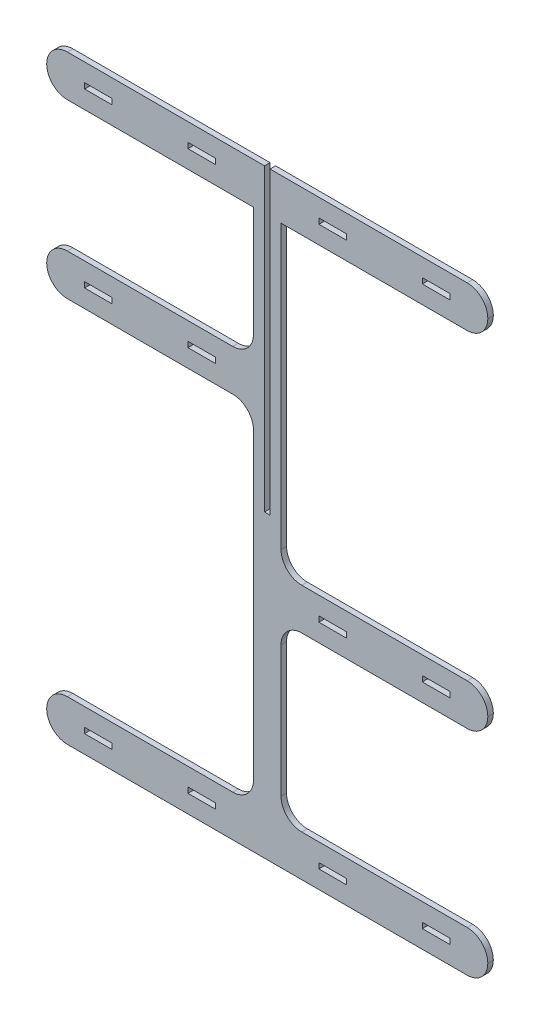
ISO-10303-21;
HEADER;
FILE_DESCRIPTION(('STEP AP214'),'2;1');
FILE_NAME('part.step','',(''),(''),'','','');
FILE_SCHEMA(('AUTOMOTIVE_DESIGN { 1 0 10303 214 1 1 1 1 }'));
ENDSEC;
DATA;
#1=APPLICATION_CONTEXT('core data for automotive mechanical design processes');
#2=APPLICATION_PROTOCOL_DEFINITION('international standard','automotive_design',2000,#1);
#3=PRODUCT_CONTEXT('',#1,'mechanical');
#4=PRODUCT('Part','Part','',(#3));
#5=PRODUCT_RELATED_PRODUCT_CATEGORY('part','',(#4));
#6=PRODUCT_DEFINITION_FORMATION('','',#4);
#7=PRODUCT_DEFINITION_CONTEXT('part definition',#1,'design');
#8=PRODUCT_DEFINITION('design','',#6,#7);
#9=PRODUCT_DEFINITION_SHAPE('','',#8);
#10=(LENGTH_UNIT() NAMED_UNIT(*) SI_UNIT(.MILLI.,.METRE.));
#11=(NAMED_UNIT(*) PLANE_ANGLE_UNIT() SI_UNIT($,.RADIAN.));
#12=(NAMED_UNIT(*) SI_UNIT($,.STERADIAN.) SOLID_ANGLE_UNIT());
#13=UNCERTAINTY_MEASURE_WITH_UNIT(LENGTH_MEASURE(1.E-05),#10,'distance_accuracy_value','');
#14=(GEOMETRIC_REPRESENTATION_CONTEXT(3) GLOBAL_UNCERTAINTY_ASSIGNED_CONTEXT((#13)) GLOBAL_UNIT_ASSIGNED_CONTEXT((#10,
#11,#12)) REPRESENTATION_CONTEXT('',''));
#15=CARTESIAN_POINT('',(0.,0.,0.));
#16=DIRECTION('',(0.,0.,1.));
#17=DIRECTION('',(1.,0.,0.));
#18=AXIS2_PLACEMENT_3D('',#15,#16,#17);
#19=CARTESIAN_POINT('',(170.,435.,2.));
#20=DIRECTION('',(0.,-1.,0.));
#21=DIRECTION('',(0.,0.,-1.));
#22=AXIS2_PLACEMENT_3D('',#19,#20,#21);
#23=PLANE('',#22);
#24=DIRECTION('',(-1.,0.,0.));
#25=VECTOR('',#24,1.);
#26=CARTESIAN_POINT('',(170.,435.,2.));
#27=LINE('',#26,#25);
#28=CARTESIAN_POINT('',(158.,435.,2.));
#29=VERTEX_POINT('',#28);
#30=CARTESIAN_POINT('',(15.,435.,2.));
#31=VERTEX_POINT('',#30);
#32=EDGE_CURVE('E872',#29,#31,#27,.T.);
#33=ORIENTED_EDGE('',*,*,#32,.F.);
#34=DIRECTION('',(0.,0.,1.));
#35=VECTOR('',#34,1.);
#36=CARTESIAN_POINT('',(158.,435.,-2.));
#37=LINE('',#36,#35);
#38=CARTESIAN_POINT('',(158.,435.,-2.));
#39=VERTEX_POINT('',#38);
#40=EDGE_CURVE('E577',#39,#29,#37,.T.);
#41=ORIENTED_EDGE('',*,*,#40,.F.);
#42=DIRECTION('',(-1.,0.,0.));
#43=VECTOR('',#42,1.);
#44=CARTESIAN_POINT('',(170.,435.,-2.));
#45=LINE('',#44,#43);
#46=CARTESIAN_POINT('',(15.,435.,-2.));
#47=VERTEX_POINT('',#46);
#48=EDGE_CURVE('E902',#39,#47,#45,.T.);
#49=ORIENTED_EDGE('',*,*,#48,.T.);
#50=DIRECTION('',(0.,0.,-1.));
#51=VECTOR('',#50,1.);
#52=CARTESIAN_POINT('',(15.,435.,2.));
#53=LINE('',#52,#51);
#54=EDGE_CURVE('E1169',#47,#31,#53,.F.);
#55=ORIENTED_EDGE('',*,*,#54,.T.);
#56=EDGE_LOOP('',(#33,#41,#49,#55));
#57=FACE_BOUND('',#56,.T.);
#58=ADVANCED_FACE('F39',(#57),#23,.F.);
#59=CARTESIAN_POINT('',(170.,200.,2.));
#60=DIRECTION('',(-1.,0.,0.));
#61=DIRECTION('',(0.,-1.,0.));
#62=AXIS2_PLACEMENT_3D('',#59,#60,#61);
#63=PLANE('',#62);
#64=DIRECTION('',(0.,0.,-1.));
#65=VECTOR('',#64,1.);
#66=CARTESIAN_POINT('',(170.,405.,2.));
#67=LINE('',#66,#65);
#68=CARTESIAN_POINT('',(170.,405.,2.));
#69=VERTEX_POINT('',#68);
#70=CARTESIAN_POINT('',(170.,405.,-2.));
#71=VERTEX_POINT('',#70);
#72=EDGE_CURVE('E725',#69,#71,#67,.T.);
#73=ORIENTED_EDGE('',*,*,#72,.F.);
#74=DIRECTION('',(0.,1.,0.));
#75=VECTOR('',#74,1.);
#76=CARTESIAN_POINT('',(170.,200.,2.));
#77=LINE('',#76,#75);
#78=CARTESIAN_POINT('',(170.,200.,2.));
#79=VERTEX_POINT('',#78);
#80=EDGE_CURVE('E869',#79,#69,#77,.T.);
#81=ORIENTED_EDGE('',*,*,#80,.F.);
#82=DIRECTION('',(0.,0.,-1.));
#83=VECTOR('',#82,1.);
#84=CARTESIAN_POINT('',(170.,200.,2.));
#85=LINE('',#84,#83);
#86=CARTESIAN_POINT('',(170.,200.,-2.));
#87=VERTEX_POINT('',#86);
#88=EDGE_CURVE('E929',#79,#87,#85,.T.);
#89=ORIENTED_EDGE('',*,*,#88,.T.);
#90=DIRECTION('',(0.,1.,0.));
#91=VECTOR('',#90,1.);
#92=CARTESIAN_POINT('',(170.,200.,-2.));
#93=LINE('',#92,#91);
#94=EDGE_CURVE('E899',#87,#71,#93,.T.);
#95=ORIENTED_EDGE('',*,*,#94,.T.);
#96=EDGE_LOOP('',(#73,#81,#89,#95));
#97=FACE_BOUND('',#96,.T.);
#98=ADVANCED_FACE('F1276',(#97),#63,.F.);
#99=CARTESIAN_POINT('',(150.,435.,2.));
#100=DIRECTION('',(1.,0.,0.));
#101=DIRECTION('',(0.,1.,0.));
#102=AXIS2_PLACEMENT_3D('',#99,#100,#101);
#103=PLANE('',#102);
#104=DIRECTION('',(0.,0.,1.));
#105=VECTOR('',#104,1.);
#106=CARTESIAN_POINT('',(150.,405.,2.));
#107=LINE('',#106,#105);
#108=CARTESIAN_POINT('',(150.,405.,-2.));
#109=VERTEX_POINT('',#108);
#110=CARTESIAN_POINT('',(150.,405.,2.));
#111=VERTEX_POINT('',#110);
#112=EDGE_CURVE('E1139',#109,#111,#107,.T.);
#113=ORIENTED_EDGE('',*,*,#112,.F.);
#114=DIRECTION('',(0.,-1.,0.));
#115=VECTOR('',#114,1.);
#116=CARTESIAN_POINT('',(150.,435.,-2.));
#117=LINE('',#116,#115);
#118=CARTESIAN_POINT('',(150.,325.,-2.));
#119=VERTEX_POINT('',#118);
#120=EDGE_CURVE('E906',#109,#119,#117,.T.);
#121=ORIENTED_EDGE('',*,*,#120,.T.);
#122=DIRECTION('',(0.,0.,-1.));
#123=VECTOR('',#122,1.);
#124=CARTESIAN_POINT('',(150.,325.,2.));
#125=LINE('',#124,#123);
#126=CARTESIAN_POINT('',(150.,325.,2.));
#127=VERTEX_POINT('',#126);
#128=EDGE_CURVE('E926',#127,#119,#125,.T.);
#129=ORIENTED_EDGE('',*,*,#128,.F.);
#130=DIRECTION('',(0.,-1.,0.));
#131=VECTOR('',#130,1.);
#132=CARTESIAN_POINT('',(150.,435.,2.));
#133=LINE('',#132,#131);
#134=EDGE_CURVE('E875',#111,#127,#133,.T.);
#135=ORIENTED_EDGE('',*,*,#134,.F.);
#136=EDGE_LOOP('',(#113,#121,#129,#135));
#137=FACE_BOUND('',#136,.T.);
#138=ADVANCED_FACE('F1319',(#137),#103,.F.);
#139=CARTESIAN_POINT('',(0.,30.,2.));
#140=DIRECTION('',(0.,-1.,0.));
#141=DIRECTION('',(0.,0.,-1.));
#142=AXIS2_PLACEMENT_3D('',#139,#140,#141);
#143=PLANE('',#142);
#144=DIRECTION('',(-1.,0.,0.));
#145=VECTOR('',#144,1.);
#146=CARTESIAN_POINT('',(0.,30.,-2.));
#147=LINE('',#146,#145);
#148=CARTESIAN_POINT('',(305.,30.,-2.));
#149=VERTEX_POINT('',#148);
#150=CARTESIAN_POINT('',(185.,30.,-2.));
#151=VERTEX_POINT('',#150);
#152=EDGE_CURVE('E1070',#149,#151,#147,.T.);
#153=ORIENTED_EDGE('',*,*,#152,.T.);
#154=DIRECTION('',(0.,0.,-1.));
#155=VECTOR('',#154,1.);
#156=CARTESIAN_POINT('',(185.,30.,2.));
#157=LINE('',#156,#155);
#158=CARTESIAN_POINT('',(185.,30.,2.));
#159=VERTEX_POINT('',#158);
#160=EDGE_CURVE('E1181',#151,#159,#157,.F.);
#161=ORIENTED_EDGE('',*,*,#160,.T.);
#162=DIRECTION('',(-1.,0.,0.));
#163=VECTOR('',#162,1.);
#164=CARTESIAN_POINT('',(0.,30.,2.));
#165=LINE('',#164,#163);
#166=CARTESIAN_POINT('',(305.,30.,2.));
#167=VERTEX_POINT('',#166);
#168=EDGE_CURVE('E1071',#167,#159,#165,.T.);
#169=ORIENTED_EDGE('',*,*,#168,.F.);
#170=DIRECTION('',(0.,0.,-1.));
#171=VECTOR('',#170,1.);
#172=CARTESIAN_POINT('',(305.,30.,2.));
#173=LINE('',#172,#171);
#174=EDGE_CURVE('E1134',#167,#149,#173,.T.);
#175=ORIENTED_EDGE('',*,*,#174,.T.);
#176=EDGE_LOOP('',(#153,#161,#169,#175));
#177=FACE_BOUND('',#176,.T.);
#178=ADVANCED_FACE('F1231',(#177),#143,.F.);
#179=CARTESIAN_POINT('',(0.,0.,2.));
#180=DIRECTION('',(0.,0.,-1.));
#181=DIRECTION('',(-1.,0.,0.));
#182=AXIS2_PLACEMENT_3D('',#179,#180,#181);
#183=PLANE('',#182);
#184=DIRECTION('',(1.,0.,0.));
#185=VECTOR('',#184,1.);
#186=CARTESIAN_POINT('',(158.,217.5,2.));
#187=LINE('',#186,#185);
#188=CARTESIAN_POINT('',(158.,217.5,2.));
#189=VERTEX_POINT('',#188);
#190=CARTESIAN_POINT('',(162.,217.5,2.));
#191=VERTEX_POINT('',#190);
#192=EDGE_CURVE('E565',#189,#191,#187,.T.);
#193=ORIENTED_EDGE('',*,*,#192,.F.);
#194=DIRECTION('',(0.,-1.,0.));
#195=VECTOR('',#194,1.);
#196=CARTESIAN_POINT('',(158.,435.,2.));
#197=LINE('',#196,#195);
#198=EDGE_CURVE('E574',#29,#189,#197,.T.);
#199=ORIENTED_EDGE('',*,*,#198,.F.);
#200=ORIENTED_EDGE('',*,*,#32,.T.);
#201=CARTESIAN_POINT('',(15.,420.,2.));
#202=DIRECTION('',(0.,0.,-1.));
#203=DIRECTION('',(-1.,0.,0.));
#204=AXIS2_PLACEMENT_3D('',#201,#202,#203);
#205=CIRCLE('',#204,15.);
#206=CARTESIAN_POINT('',(0.,420.,2.));
#207=VERTEX_POINT('',#206);
#208=EDGE_CURVE('E1158',#31,#207,#205,.F.);
#209=ORIENTED_EDGE('',*,*,#208,.T.);
#210=CARTESIAN_POINT('',(15.0000000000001,420.,2.));
#211=DIRECTION('',(0.,0.,-1.));
#212=DIRECTION('',(-1.,0.,0.));
#213=AXIS2_PLACEMENT_3D('',#210,#211,#212);
#214=CIRCLE('',#213,15.);
#215=CARTESIAN_POINT('',(15.0000000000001,405.,2.));
#216=VERTEX_POINT('',#215);
#217=EDGE_CURVE('E1160',#207,#216,#214,.F.);
#218=ORIENTED_EDGE('',*,*,#217,.T.);
#219=DIRECTION('',(1.,0.,0.));
#220=VECTOR('',#219,1.);
#221=CARTESIAN_POINT('',(320.,405.,2.));
#222=LINE('',#221,#220);
#223=EDGE_CURVE('E723',#216,#111,#222,.T.);
#224=ORIENTED_EDGE('',*,*,#223,.T.);
#225=ORIENTED_EDGE('',*,*,#134,.T.);
#226=CARTESIAN_POINT('',(135.,325.,2.));
#227=DIRECTION('',(0.,0.,-1.));
#228=DIRECTION('',(-1.,0.,0.));
#229=AXIS2_PLACEMENT_3D('',#226,#227,#228);
#230=CIRCLE('',#229,15.);
#231=CARTESIAN_POINT('',(135.,310.,2.));
#232=VERTEX_POINT('',#231);
#233=EDGE_CURVE('E877',#127,#232,#230,.T.);
#234=ORIENTED_EDGE('',*,*,#233,.T.);
#235=DIRECTION('',(-1.,0.,0.));
#236=VECTOR('',#235,1.);
#237=CARTESIAN_POINT('',(135.,310.,2.));
#238=LINE('',#237,#236);
#239=CARTESIAN_POINT('',(15.,310.,2.));
#240=VERTEX_POINT('',#239);
#241=EDGE_CURVE('E879',#232,#240,#238,.T.);
#242=ORIENTED_EDGE('',*,*,#241,.T.);
#243=CARTESIAN_POINT('',(15.,295.,2.));
#244=DIRECTION('',(0.,0.,-1.));
#245=DIRECTION('',(-1.,0.,0.));
#246=AXIS2_PLACEMENT_3D('',#243,#244,#245);
#247=CIRCLE('',#246,15.);
#248=CARTESIAN_POINT('',(0.,295.,2.));
#249=VERTEX_POINT('',#248);
#250=EDGE_CURVE('E1090',#240,#249,#247,.F.);
#251=ORIENTED_EDGE('',*,*,#250,.T.);
#252=CARTESIAN_POINT('',(15.,295.,2.));
#253=DIRECTION('',(0.,0.,-1.));
#254=DIRECTION('',(-1.,0.,0.));
#255=AXIS2_PLACEMENT_3D('',#252,#253,#254);
#256=CIRCLE('',#255,15.);
#257=CARTESIAN_POINT('',(15.,280.,2.));
#258=VERTEX_POINT('',#257);
#259=EDGE_CURVE('E1092',#249,#258,#256,.F.);
#260=ORIENTED_EDGE('',*,*,#259,.T.);
#261=DIRECTION('',(1.,0.,0.));
#262=VECTOR('',#261,1.);
#263=CARTESIAN_POINT('',(0.,280.,2.));
#264=LINE('',#263,#262);
#265=CARTESIAN_POINT('',(135.,280.,2.));
#266=VERTEX_POINT('',#265);
#267=EDGE_CURVE('E882',#258,#266,#264,.T.);
#268=ORIENTED_EDGE('',*,*,#267,.T.);
#269=CARTESIAN_POINT('',(135.,265.,2.));
#270=DIRECTION('',(0.,0.,-1.));
#271=DIRECTION('',(-1.,0.,0.));
#272=AXIS2_PLACEMENT_3D('',#269,#270,#271);
#273=CIRCLE('',#272,15.);
#274=CARTESIAN_POINT('',(150.,265.,2.));
#275=VERTEX_POINT('',#274);
#276=EDGE_CURVE('E884',#266,#275,#273,.T.);
#277=ORIENTED_EDGE('',*,*,#276,.T.);
#278=DIRECTION('',(0.,-1.,0.));
#279=VECTOR('',#278,1.);
#280=CARTESIAN_POINT('',(150.,265.,2.));
#281=LINE('',#280,#279);
#282=CARTESIAN_POINT('',(150.,45.,2.));
#283=VERTEX_POINT('',#282);
#284=EDGE_CURVE('E886',#275,#283,#281,.T.);
#285=ORIENTED_EDGE('',*,*,#284,.T.);
#286=CARTESIAN_POINT('',(135.,45.,2.));
#287=DIRECTION('',(0.,0.,-1.));
#288=DIRECTION('',(-1.,0.,0.));
#289=AXIS2_PLACEMENT_3D('',#286,#287,#288);
#290=CIRCLE('',#289,15.);
#291=CARTESIAN_POINT('',(135.,30.,2.));
#292=VERTEX_POINT('',#291);
#293=EDGE_CURVE('E11',#283,#292,#290,.T.);
#294=ORIENTED_EDGE('',*,*,#293,.T.);
#295=CARTESIAN_POINT('',(15.,30.,2.));
#296=VERTEX_POINT('',#295);
#297=EDGE_CURVE('E1069',#292,#296,#165,.T.);
#298=ORIENTED_EDGE('',*,*,#297,.T.);
#299=CARTESIAN_POINT('',(15.,15.,2.));
#300=DIRECTION('',(0.,0.,-1.));
#301=DIRECTION('',(-1.,0.,0.));
#302=AXIS2_PLACEMENT_3D('',#299,#300,#301);
#303=CIRCLE('',#302,15.);
#304=CARTESIAN_POINT('',(0.,15.,2.));
#305=VERTEX_POINT('',#304);
#306=EDGE_CURVE('E1126',#296,#305,#303,.F.);
#307=ORIENTED_EDGE('',*,*,#306,.T.);
#308=CARTESIAN_POINT('',(15.,15.,2.));
#309=DIRECTION('',(0.,0.,-1.));
#310=DIRECTION('',(-1.,0.,0.));
#311=AXIS2_PLACEMENT_3D('',#308,#309,#310);
#312=CIRCLE('',#311,15.);
#313=CARTESIAN_POINT('',(15.,0.,2.));
#314=VERTEX_POINT('',#313);
#315=EDGE_CURVE('E1128',#305,#314,#312,.F.);
#316=ORIENTED_EDGE('',*,*,#315,.T.);
#317=DIRECTION('',(1.,0.,0.));
#318=VECTOR('',#317,1.);
#319=CARTESIAN_POINT('',(320.,0.,2.));
#320=LINE('',#319,#318);
#321=CARTESIAN_POINT('',(305.,0.,2.));
#322=VERTEX_POINT('',#321);
#323=EDGE_CURVE('E1066',#314,#322,#320,.T.);
#324=ORIENTED_EDGE('',*,*,#323,.T.);
#325=CARTESIAN_POINT('',(305.,15.,2.));
#326=DIRECTION('',(0.,0.,-1.));
#327=DIRECTION('',(-1.,0.,0.));
#328=AXIS2_PLACEMENT_3D('',#325,#326,#327);
#329=CIRCLE('',#328,15.);
#330=CARTESIAN_POINT('',(320.,15.,2.));
#331=VERTEX_POINT('',#330);
#332=EDGE_CURVE('E1132',#322,#331,#329,.F.);
#333=ORIENTED_EDGE('',*,*,#332,.T.);
#334=CARTESIAN_POINT('',(305.,15.,2.));
#335=DIRECTION('',(0.,0.,-1.));
#336=DIRECTION('',(-1.,0.,0.));
#337=AXIS2_PLACEMENT_3D('',#334,#335,#336);
#338=CIRCLE('',#337,15.);
#339=EDGE_CURVE('E1130',#331,#167,#338,.F.);
#340=ORIENTED_EDGE('',*,*,#339,.T.);
#341=ORIENTED_EDGE('',*,*,#168,.T.);
#342=CARTESIAN_POINT('',(185.,45.,2.));
#343=DIRECTION('',(0.,0.,-1.));
#344=DIRECTION('',(-1.,0.,0.));
#345=AXIS2_PLACEMENT_3D('',#342,#343,#344);
#346=CIRCLE('',#345,15.);
#347=CARTESIAN_POINT('',(170.,45.,2.));
#348=VERTEX_POINT('',#347);
#349=EDGE_CURVE('E1189',#159,#348,#346,.T.);
#350=ORIENTED_EDGE('',*,*,#349,.T.);
#351=DIRECTION('',(0.,1.,0.));
#352=VECTOR('',#351,1.);
#353=CARTESIAN_POINT('',(170.,30.,2.));
#354=LINE('',#353,#352);
#355=CARTESIAN_POINT('',(170.,140.,2.));
#356=VERTEX_POINT('',#355);
#357=EDGE_CURVE('E857',#348,#356,#354,.T.);
#358=ORIENTED_EDGE('',*,*,#357,.T.);
#359=CARTESIAN_POINT('',(185.,140.,2.));
#360=DIRECTION('',(0.,0.,-1.));
#361=DIRECTION('',(-1.,0.,0.));
#362=AXIS2_PLACEMENT_3D('',#359,#360,#361);
#363=CIRCLE('',#362,15.);
#364=CARTESIAN_POINT('',(185.,155.,2.));
#365=VERTEX_POINT('',#364);
#366=EDGE_CURVE('E859',#356,#365,#363,.T.);
#367=ORIENTED_EDGE('',*,*,#366,.T.);
#368=DIRECTION('',(1.,0.,0.));
#369=VECTOR('',#368,1.);
#370=CARTESIAN_POINT('',(185.,155.,2.));
#371=LINE('',#370,#369);
#372=CARTESIAN_POINT('',(305.,155.,2.));
#373=VERTEX_POINT('',#372);
#374=EDGE_CURVE('E862',#365,#373,#371,.T.);
#375=ORIENTED_EDGE('',*,*,#374,.T.);
#376=CARTESIAN_POINT('',(305.,170.,2.));
#377=DIRECTION('',(0.,0.,-1.));
#378=DIRECTION('',(-1.,0.,0.));
#379=AXIS2_PLACEMENT_3D('',#376,#377,#378);
#380=CIRCLE('',#379,15.);
#381=CARTESIAN_POINT('',(320.,170.,2.));
#382=VERTEX_POINT('',#381);
#383=EDGE_CURVE('E1096',#373,#382,#380,.F.);
#384=ORIENTED_EDGE('',*,*,#383,.T.);
#385=CARTESIAN_POINT('',(305.,170.,2.));
#386=DIRECTION('',(0.,0.,-1.));
#387=DIRECTION('',(-1.,0.,0.));
#388=AXIS2_PLACEMENT_3D('',#385,#386,#387);
#389=CIRCLE('',#388,15.);
#390=CARTESIAN_POINT('',(305.,185.,2.));
#391=VERTEX_POINT('',#390);
#392=EDGE_CURVE('E1094',#382,#391,#389,.F.);
#393=ORIENTED_EDGE('',*,*,#392,.T.);
#394=DIRECTION('',(-1.,0.,0.));
#395=VECTOR('',#394,1.);
#396=CARTESIAN_POINT('',(320.,185.,2.));
#397=LINE('',#396,#395);
#398=CARTESIAN_POINT('',(185.,185.,2.));
#399=VERTEX_POINT('',#398);
#400=EDGE_CURVE('E865',#391,#399,#397,.T.);
#401=ORIENTED_EDGE('',*,*,#400,.T.);
#402=CARTESIAN_POINT('',(185.,200.,2.));
#403=DIRECTION('',(0.,0.,-1.));
#404=DIRECTION('',(-1.,0.,0.));
#405=AXIS2_PLACEMENT_3D('',#402,#403,#404);
#406=CIRCLE('',#405,15.);
#407=EDGE_CURVE('E867',#399,#79,#406,.T.);
#408=ORIENTED_EDGE('',*,*,#407,.T.);
#409=ORIENTED_EDGE('',*,*,#80,.T.);
#410=CARTESIAN_POINT('',(305.,405.,2.));
#411=VERTEX_POINT('',#410);
#412=EDGE_CURVE('E726',#69,#411,#222,.T.);
#413=ORIENTED_EDGE('',*,*,#412,.T.);
#414=CARTESIAN_POINT('',(305.,420.,2.));
#415=DIRECTION('',(0.,0.,-1.));
#416=DIRECTION('',(-1.,0.,0.));
#417=AXIS2_PLACEMENT_3D('',#414,#415,#416);
#418=CIRCLE('',#417,15.);
#419=CARTESIAN_POINT('',(320.,420.,2.));
#420=VERTEX_POINT('',#419);
#421=EDGE_CURVE('E1164',#411,#420,#418,.F.);
#422=ORIENTED_EDGE('',*,*,#421,.T.);
#423=CARTESIAN_POINT('',(305.,420.,2.));
#424=DIRECTION('',(0.,0.,-1.));
#425=DIRECTION('',(-1.,0.,0.));
#426=AXIS2_PLACEMENT_3D('',#423,#424,#425);
#427=CIRCLE('',#426,15.);
#428=CARTESIAN_POINT('',(305.,435.,2.));
#429=VERTEX_POINT('',#428);
#430=EDGE_CURVE('E1162',#420,#429,#427,.F.);
#431=ORIENTED_EDGE('',*,*,#430,.T.);
#432=CARTESIAN_POINT('',(162.,435.,2.));
#433=VERTEX_POINT('',#432);
#434=EDGE_CURVE('E873',#429,#433,#27,.T.);
#435=ORIENTED_EDGE('',*,*,#434,.T.);
#436=DIRECTION('',(0.,1.,0.));
#437=VECTOR('',#436,1.);
#438=CARTESIAN_POINT('',(162.,435.,2.));
#439=LINE('',#438,#437);
#440=EDGE_CURVE('E54',#191,#433,#439,.T.);
#441=ORIENTED_EDGE('',*,*,#440,.F.);
#442=EDGE_LOOP('',(#193,#199,#200,#209,#218,#224,#225,#234,#242,#251,#260,#268,#277,#285,#294,
#298,#307,#316,#324,#333,#340,#341,#350,#358,#367,#375,#384,#393,#401,#408,#409,#413,#422,#431,
#435,#441));
#443=FACE_BOUND('',#442,.T.);
#444=DIRECTION('',(0.,1.,0.));
#445=VECTOR('',#444,1.);
#446=CARTESIAN_POINT('',(122.5,418.,2.));
#447=LINE('',#446,#445);
#448=CARTESIAN_POINT('',(122.5,418.,2.));
#449=VERTEX_POINT('',#448);
#450=CARTESIAN_POINT('',(122.5,422.,2.));
#451=VERTEX_POINT('',#450);
#452=EDGE_CURVE('E661',#449,#451,#447,.T.);
#453=ORIENTED_EDGE('',*,*,#452,.F.);
#454=DIRECTION('',(1.,0.,0.));
#455=VECTOR('',#454,1.);
#456=CARTESIAN_POINT('',(102.5,418.,2.));
#457=LINE('',#456,#455);
#458=CARTESIAN_POINT('',(102.5,418.,2.));
#459=VERTEX_POINT('',#458);
#460=EDGE_CURVE('E669',#459,#449,#457,.T.);
#461=ORIENTED_EDGE('',*,*,#460,.F.);
#462=DIRECTION('',(0.,-1.,0.));
#463=VECTOR('',#462,1.);
#464=CARTESIAN_POINT('',(102.5,418.,2.));
#465=LINE('',#464,#463);
#466=CARTESIAN_POINT('',(102.5,422.,2.));
#467=VERTEX_POINT('',#466);
#468=EDGE_CURVE('E666',#467,#459,#465,.T.);
#469=ORIENTED_EDGE('',*,*,#468,.F.);
#470=DIRECTION('',(-1.,0.,0.));
#471=VECTOR('',#470,1.);
#472=CARTESIAN_POINT('',(102.5,422.,2.));
#473=LINE('',#472,#471);
#474=EDGE_CURVE('E663',#451,#467,#473,.T.);
#475=ORIENTED_EDGE('',*,*,#474,.F.);
#476=EDGE_LOOP('',(#453,#461,#469,#475));
#477=FACE_BOUND('',#476,.T.);
#478=DIRECTION('',(0.,1.,0.));
#479=VECTOR('',#478,1.);
#480=CARTESIAN_POINT('',(47.5,418.,2.));
#481=LINE('',#480,#479);
#482=CARTESIAN_POINT('',(47.5,418.,2.));
#483=VERTEX_POINT('',#482);
#484=CARTESIAN_POINT('',(47.5,422.,2.));
#485=VERTEX_POINT('',#484);
#486=EDGE_CURVE('E692',#483,#485,#481,.T.);
#487=ORIENTED_EDGE('',*,*,#486,.F.);
#488=DIRECTION('',(1.,0.,0.));
#489=VECTOR('',#488,1.);
#490=CARTESIAN_POINT('',(27.5,418.,2.));
#491=LINE('',#490,#489);
#492=CARTESIAN_POINT('',(27.5,418.,2.));
#493=VERTEX_POINT('',#492);
#494=EDGE_CURVE('E700',#493,#483,#491,.T.);
#495=ORIENTED_EDGE('',*,*,#494,.F.);
#496=DIRECTION('',(0.,-1.,0.));
#497=VECTOR('',#496,1.);
#498=CARTESIAN_POINT('',(27.5,418.,2.));
#499=LINE('',#498,#497);
#500=CARTESIAN_POINT('',(27.5,422.,2.));
#501=VERTEX_POINT('',#500);
#502=EDGE_CURVE('E697',#501,#493,#499,.T.);
#503=ORIENTED_EDGE('',*,*,#502,.F.);
#504=DIRECTION('',(-1.,0.,0.));
#505=VECTOR('',#504,1.);
#506=CARTESIAN_POINT('',(27.5,422.,2.));
#507=LINE('',#506,#505);
#508=EDGE_CURVE('E694',#485,#501,#507,.T.);
#509=ORIENTED_EDGE('',*,*,#508,.F.);
#510=EDGE_LOOP('',(#487,#495,#503,#509));
#511=FACE_BOUND('',#510,.T.);
#512=DIRECTION('',(0.,1.,0.));
#513=VECTOR('',#512,1.);
#514=CARTESIAN_POINT('',(217.5,418.,2.));
#515=LINE('',#514,#513);
#516=CARTESIAN_POINT('',(217.5,418.,2.));
#517=VERTEX_POINT('',#516);
#518=CARTESIAN_POINT('',(217.5,422.,2.));
#519=VERTEX_POINT('',#518);
#520=EDGE_CURVE('E630',#517,#519,#515,.T.);
#521=ORIENTED_EDGE('',*,*,#520,.F.);
#522=DIRECTION('',(1.,0.,0.));
#523=VECTOR('',#522,1.);
#524=CARTESIAN_POINT('',(217.5,418.,2.));
#525=LINE('',#524,#523);
#526=CARTESIAN_POINT('',(197.5,418.,2.));
#527=VERTEX_POINT('',#526);
#528=EDGE_CURVE('E638',#527,#517,#525,.T.);
#529=ORIENTED_EDGE('',*,*,#528,.F.);
#530=DIRECTION('',(0.,-1.,0.));
#531=VECTOR('',#530,1.);
#532=CARTESIAN_POINT('',(197.5,418.,2.));
#533=LINE('',#532,#531);
#534=CARTESIAN_POINT('',(197.5,422.,2.));
#535=VERTEX_POINT('',#534);
#536=EDGE_CURVE('E635',#535,#527,#533,.T.);
#537=ORIENTED_EDGE('',*,*,#536,.F.);
#538=DIRECTION('',(-1.,0.,0.));
#539=VECTOR('',#538,1.);
#540=CARTESIAN_POINT('',(217.5,422.,2.));
#541=LINE('',#540,#539);
#542=EDGE_CURVE('E632',#519,#535,#541,.T.);
#543=ORIENTED_EDGE('',*,*,#542,.F.);
#544=EDGE_LOOP('',(#521,#529,#537,#543));
#545=FACE_BOUND('',#544,.T.);
#546=DIRECTION('',(0.,1.,0.));
#547=VECTOR('',#546,1.);
#548=CARTESIAN_POINT('',(292.5,418.,2.));
#549=LINE('',#548,#547);
#550=CARTESIAN_POINT('',(292.5,418.,2.));
#551=VERTEX_POINT('',#550);
#552=CARTESIAN_POINT('',(292.5,422.,2.));
#553=VERTEX_POINT('',#552);
#554=EDGE_CURVE('E597',#551,#553,#549,.T.);
#555=ORIENTED_EDGE('',*,*,#554,.F.);
#556=DIRECTION('',(1.,0.,0.));
#557=VECTOR('',#556,1.);
#558=CARTESIAN_POINT('',(292.5,418.,2.));
#559=LINE('',#558,#557);
#560=CARTESIAN_POINT('',(272.5,418.,2.));
#561=VERTEX_POINT('',#560);
#562=EDGE_CURVE('E605',#561,#551,#559,.T.);
#563=ORIENTED_EDGE('',*,*,#562,.F.);
#564=DIRECTION('',(0.,-1.,0.));
#565=VECTOR('',#564,1.);
#566=CARTESIAN_POINT('',(272.5,418.,2.));
#567=LINE('',#566,#565);
#568=CARTESIAN_POINT('',(272.5,422.,2.));
#569=VERTEX_POINT('',#568);
#570=EDGE_CURVE('E602',#569,#561,#567,.T.);
#571=ORIENTED_EDGE('',*,*,#570,.F.);
#572=DIRECTION('',(-1.,0.,0.));
#573=VECTOR('',#572,1.);
#574=CARTESIAN_POINT('',(292.5,422.,2.));
#575=LINE('',#574,#573);
#576=EDGE_CURVE('E599',#553,#569,#575,.T.);
#577=ORIENTED_EDGE('',*,*,#576,.F.);
#578=EDGE_LOOP('',(#555,#563,#571,#577));
#579=FACE_BOUND('',#578,.T.);
#580=DIRECTION('',(0.,1.,0.));
#581=VECTOR('',#580,1.);
#582=CARTESIAN_POINT('',(217.5,168.,2.));
#583=LINE('',#582,#581);
#584=CARTESIAN_POINT('',(217.5,168.,2.));
#585=VERTEX_POINT('',#584);
#586=CARTESIAN_POINT('',(217.5,172.,2.));
#587=VERTEX_POINT('',#586);
#588=EDGE_CURVE('E731',#585,#587,#583,.T.);
#589=ORIENTED_EDGE('',*,*,#588,.F.);
#590=DIRECTION('',(1.,0.,0.));
#591=VECTOR('',#590,1.);
#592=CARTESIAN_POINT('',(197.5,168.,2.));
#593=LINE('',#592,#591);
#594=CARTESIAN_POINT('',(197.5,168.,2.));
#595=VERTEX_POINT('',#594);
#596=EDGE_CURVE('E739',#595,#585,#593,.T.);
#597=ORIENTED_EDGE('',*,*,#596,.F.);
#598=DIRECTION('',(0.,-1.,0.));
#599=VECTOR('',#598,1.);
#600=CARTESIAN_POINT('',(197.5,168.,2.));
#601=LINE('',#600,#599);
#602=CARTESIAN_POINT('',(197.5,172.,2.));
#603=VERTEX_POINT('',#602);
#604=EDGE_CURVE('E736',#603,#595,#601,.T.);
#605=ORIENTED_EDGE('',*,*,#604,.F.);
#606=DIRECTION('',(-1.,0.,0.));
#607=VECTOR('',#606,1.);
#608=CARTESIAN_POINT('',(197.5,172.,2.));
#609=LINE('',#608,#607);
#610=EDGE_CURVE('E733',#587,#603,#609,.T.);
#611=ORIENTED_EDGE('',*,*,#610,.F.);
#612=EDGE_LOOP('',(#589,#597,#605,#611));
#613=FACE_BOUND('',#612,.T.);
#614=DIRECTION('',(0.,1.,0.));
#615=VECTOR('',#614,1.);
#616=CARTESIAN_POINT('',(47.5,293.,2.));
#617=LINE('',#616,#615);
#618=CARTESIAN_POINT('',(47.5,293.,2.));
#619=VERTEX_POINT('',#618);
#620=CARTESIAN_POINT('',(47.5,297.,2.));
#621=VERTEX_POINT('',#620);
#622=EDGE_CURVE('E795',#619,#621,#617,.T.);
#623=ORIENTED_EDGE('',*,*,#622,.F.);
#624=DIRECTION('',(1.,0.,0.));
#625=VECTOR('',#624,1.);
#626=CARTESIAN_POINT('',(27.5,293.,2.));
#627=LINE('',#626,#625);
#628=CARTESIAN_POINT('',(27.5,293.,2.));
#629=VERTEX_POINT('',#628);
#630=EDGE_CURVE('E803',#629,#619,#627,.T.);
#631=ORIENTED_EDGE('',*,*,#630,.F.);
#632=DIRECTION('',(0.,-1.,0.));
#633=VECTOR('',#632,1.);
#634=CARTESIAN_POINT('',(27.5,293.,2.));
#635=LINE('',#634,#633);
#636=CARTESIAN_POINT('',(27.5,297.,2.));
#637=VERTEX_POINT('',#636);
#638=EDGE_CURVE('E800',#637,#629,#635,.T.);
#639=ORIENTED_EDGE('',*,*,#638,.F.);
#640=DIRECTION('',(-1.,0.,0.));
#641=VECTOR('',#640,1.);
#642=CARTESIAN_POINT('',(27.5,297.,2.));
#643=LINE('',#642,#641);
#644=EDGE_CURVE('E797',#621,#637,#643,.T.);
#645=ORIENTED_EDGE('',*,*,#644,.F.);
#646=EDGE_LOOP('',(#623,#631,#639,#645));
#647=FACE_BOUND('',#646,.T.);
#648=DIRECTION('',(-1.,0.,0.));
#649=VECTOR('',#648,1.);
#650=CARTESIAN_POINT('',(102.5,297.,2.));
#651=LINE('',#650,#649);
#652=CARTESIAN_POINT('',(122.5,297.,2.));
#653=VERTEX_POINT('',#652);
#654=CARTESIAN_POINT('',(102.5,297.,2.));
#655=VERTEX_POINT('',#654);
#656=EDGE_CURVE('E826',#653,#655,#651,.T.);
#657=ORIENTED_EDGE('',*,*,#656,.F.);
#658=DIRECTION('',(0.,1.,0.));
#659=VECTOR('',#658,1.);
#660=CARTESIAN_POINT('',(122.5,293.,2.));
#661=LINE('',#660,#659);
#662=CARTESIAN_POINT('',(122.5,293.,2.));
#663=VERTEX_POINT('',#662);
#664=EDGE_CURVE('E834',#663,#653,#661,.T.);
#665=ORIENTED_EDGE('',*,*,#664,.F.);
#666=DIRECTION('',(1.,0.,0.));
#667=VECTOR('',#666,1.);
#668=CARTESIAN_POINT('',(102.5,293.,2.));
#669=LINE('',#668,#667);
#670=CARTESIAN_POINT('',(102.5,293.,2.));
#671=VERTEX_POINT('',#670);
#672=EDGE_CURVE('E831',#671,#663,#669,.T.);
#673=ORIENTED_EDGE('',*,*,#672,.F.);
#674=DIRECTION('',(0.,-1.,0.));
#675=VECTOR('',#674,1.);
#676=CARTESIAN_POINT('',(102.5,293.,2.));
#677=LINE('',#676,#675);
#678=EDGE_CURVE('E828',#655,#671,#677,.T.);
#679=ORIENTED_EDGE('',*,*,#678,.F.);
#680=EDGE_LOOP('',(#657,#665,#673,#679));
#681=FACE_BOUND('',#680,.T.);
#682=DIRECTION('',(0.,1.,0.));
#683=VECTOR('',#682,1.);
#684=CARTESIAN_POINT('',(292.5,168.,2.));
#685=LINE('',#684,#683);
#686=CARTESIAN_POINT('',(292.5,168.,2.));
#687=VERTEX_POINT('',#686);
#688=CARTESIAN_POINT('',(292.5,172.,2.));
#689=VERTEX_POINT('',#688);
#690=EDGE_CURVE('E764',#687,#689,#685,.T.);
#691=ORIENTED_EDGE('',*,*,#690,.F.);
#692=DIRECTION('',(1.,0.,0.));
#693=VECTOR('',#692,1.);
#694=CARTESIAN_POINT('',(272.5,168.,2.));
#695=LINE('',#694,#693);
#696=CARTESIAN_POINT('',(272.5,168.,2.));
#697=VERTEX_POINT('',#696);
#698=EDGE_CURVE('E772',#697,#687,#695,.T.);
#699=ORIENTED_EDGE('',*,*,#698,.F.);
#700=DIRECTION('',(0.,-1.,0.));
#701=VECTOR('',#700,1.);
#702=CARTESIAN_POINT('',(272.5,168.,2.));
#703=LINE('',#702,#701);
#704=CARTESIAN_POINT('',(272.5,172.,2.));
#705=VERTEX_POINT('',#704);
#706=EDGE_CURVE('E769',#705,#697,#703,.T.);
#707=ORIENTED_EDGE('',*,*,#706,.F.);
#708=DIRECTION('',(-1.,0.,0.));
#709=VECTOR('',#708,1.);
#710=CARTESIAN_POINT('',(272.5,172.,2.));
#711=LINE('',#710,#709);
#712=EDGE_CURVE('E766',#689,#705,#711,.T.);
#713=ORIENTED_EDGE('',*,*,#712,.F.);
#714=EDGE_LOOP('',(#691,#699,#707,#713));
#715=FACE_BOUND('',#714,.T.);
#716=DIRECTION('',(0.,1.,0.));
#717=VECTOR('',#716,1.);
#718=CARTESIAN_POINT('',(292.5,13.,2.));
#719=LINE('',#718,#717);
#720=CARTESIAN_POINT('',(292.5,13.,2.));
#721=VERTEX_POINT('',#720);
#722=CARTESIAN_POINT('',(292.5,17.,2.));
#723=VERTEX_POINT('',#722);
#724=EDGE_CURVE('E942',#721,#723,#719,.T.);
#725=ORIENTED_EDGE('',*,*,#724,.F.);
#726=DIRECTION('',(1.,0.,0.));
#727=VECTOR('',#726,1.);
#728=CARTESIAN_POINT('',(292.5,13.,2.));
#729=LINE('',#728,#727);
#730=CARTESIAN_POINT('',(272.5,13.,2.));
#731=VERTEX_POINT('',#730);
#732=EDGE_CURVE('E950',#731,#721,#729,.T.);
#733=ORIENTED_EDGE('',*,*,#732,.F.);
#734=DIRECTION('',(0.,-1.,0.));
#735=VECTOR('',#734,1.);
#736=CARTESIAN_POINT('',(272.5,13.,2.));
#737=LINE('',#736,#735);
#738=CARTESIAN_POINT('',(272.5,17.,2.));
#739=VERTEX_POINT('',#738);
#740=EDGE_CURVE('E947',#739,#731,#737,.T.);
#741=ORIENTED_EDGE('',*,*,#740,.F.);
#742=DIRECTION('',(-1.,0.,0.));
#743=VECTOR('',#742,1.);
#744=CARTESIAN_POINT('',(292.5,17.,2.));
#745=LINE('',#744,#743);
#746=EDGE_CURVE('E944',#723,#739,#745,.T.);
#747=ORIENTED_EDGE('',*,*,#746,.F.);
#748=EDGE_LOOP('',(#725,#733,#741,#747));
#749=FACE_BOUND('',#748,.T.);
#750=DIRECTION('',(0.,1.,0.));
#751=VECTOR('',#750,1.);
#752=CARTESIAN_POINT('',(122.5,13.,2.));
#753=LINE('',#752,#751);
#754=CARTESIAN_POINT('',(122.5,13.,2.));
#755=VERTEX_POINT('',#754);
#756=CARTESIAN_POINT('',(122.5,17.,2.));
#757=VERTEX_POINT('',#756);
#758=EDGE_CURVE('E1004',#755,#757,#753,.T.);
#759=ORIENTED_EDGE('',*,*,#758,.F.);
#760=DIRECTION('',(1.,0.,0.));
#761=VECTOR('',#760,1.);
#762=CARTESIAN_POINT('',(102.5,13.,2.));
#763=LINE('',#762,#761);
#764=CARTESIAN_POINT('',(102.5,13.,2.));
#765=VERTEX_POINT('',#764);
#766=EDGE_CURVE('E1012',#765,#755,#763,.T.);
#767=ORIENTED_EDGE('',*,*,#766,.F.);
#768=DIRECTION('',(0.,-1.,0.));
#769=VECTOR('',#768,1.);
#770=CARTESIAN_POINT('',(102.5,13.,2.));
#771=LINE('',#770,#769);
#772=CARTESIAN_POINT('',(102.5,17.,2.));
#773=VERTEX_POINT('',#772);
#774=EDGE_CURVE('E1009',#773,#765,#771,.T.);
#775=ORIENTED_EDGE('',*,*,#774,.F.);
#776=DIRECTION('',(-1.,0.,0.));
#777=VECTOR('',#776,1.);
#778=CARTESIAN_POINT('',(102.5,17.,2.));
#779=LINE('',#778,#777);
#780=EDGE_CURVE('E1006',#757,#773,#779,.T.);
#781=ORIENTED_EDGE('',*,*,#780,.F.);
#782=EDGE_LOOP('',(#759,#767,#775,#781));
#783=FACE_BOUND('',#782,.T.);
#784=DIRECTION('',(0.,1.,0.));
#785=VECTOR('',#784,1.);
#786=CARTESIAN_POINT('',(47.5,13.,2.));
#787=LINE('',#786,#785);
#788=CARTESIAN_POINT('',(47.5,13.,2.));
#789=VERTEX_POINT('',#788);
#790=CARTESIAN_POINT('',(47.5,17.,2.));
#791=VERTEX_POINT('',#790);
#792=EDGE_CURVE('E1035',#789,#791,#787,.T.);
#793=ORIENTED_EDGE('',*,*,#792,.F.);
#794=DIRECTION('',(1.,0.,0.));
#795=VECTOR('',#794,1.);
#796=CARTESIAN_POINT('',(27.5,13.,2.));
#797=LINE('',#796,#795);
#798=CARTESIAN_POINT('',(27.5,13.,2.));
#799=VERTEX_POINT('',#798);
#800=EDGE_CURVE('E1043',#799,#789,#797,.T.);
#801=ORIENTED_EDGE('',*,*,#800,.F.);
#802=DIRECTION('',(0.,-1.,0.));
#803=VECTOR('',#802,1.);
#804=CARTESIAN_POINT('',(27.5,13.,2.));
#805=LINE('',#804,#803);
#806=CARTESIAN_POINT('',(27.5,17.,2.));
#807=VERTEX_POINT('',#806);
#808=EDGE_CURVE('E1040',#807,#799,#805,.T.);
#809=ORIENTED_EDGE('',*,*,#808,.F.);
#810=DIRECTION('',(-1.,0.,0.));
#811=VECTOR('',#810,1.);
#812=CARTESIAN_POINT('',(27.5,17.,2.));
#813=LINE('',#812,#811);
#814=EDGE_CURVE('E1037',#791,#807,#813,.T.);
#815=ORIENTED_EDGE('',*,*,#814,.F.);
#816=EDGE_LOOP('',(#793,#801,#809,#815));
#817=FACE_BOUND('',#816,.T.);
#818=DIRECTION('',(0.,1.,0.));
#819=VECTOR('',#818,1.);
#820=CARTESIAN_POINT('',(217.5,13.,2.));
#821=LINE('',#820,#819);
#822=CARTESIAN_POINT('',(217.5,13.,2.));
#823=VERTEX_POINT('',#822);
#824=CARTESIAN_POINT('',(217.5,17.,2.));
#825=VERTEX_POINT('',#824);
#826=EDGE_CURVE('E973',#823,#825,#821,.T.);
#827=ORIENTED_EDGE('',*,*,#826,.F.);
#828=DIRECTION('',(1.,0.,0.));
#829=VECTOR('',#828,1.);
#830=CARTESIAN_POINT('',(217.5,13.,2.));
#831=LINE('',#830,#829);
#832=CARTESIAN_POINT('',(197.5,13.,2.));
#833=VERTEX_POINT('',#832);
#834=EDGE_CURVE('E981',#833,#823,#831,.T.);
#835=ORIENTED_EDGE('',*,*,#834,.F.);
#836=DIRECTION('',(0.,-1.,0.));
#837=VECTOR('',#836,1.);
#838=CARTESIAN_POINT('',(197.5,13.,2.));
#839=LINE('',#838,#837);
#840=CARTESIAN_POINT('',(197.5,17.,2.));
#841=VERTEX_POINT('',#840);
#842=EDGE_CURVE('E978',#841,#833,#839,.T.);
#843=ORIENTED_EDGE('',*,*,#842,.F.);
#844=DIRECTION('',(-1.,0.,0.));
#845=VECTOR('',#844,1.);
#846=CARTESIAN_POINT('',(217.5,17.,2.));
#847=LINE('',#846,#845);
#848=EDGE_CURVE('E975',#825,#841,#847,.T.);
#849=ORIENTED_EDGE('',*,*,#848,.F.);
#850=EDGE_LOOP('',(#827,#835,#843,#849));
#851=FACE_BOUND('',#850,.T.);
#852=ADVANCED_FACE('F581',(#443,#477,#511,#545,#579,#613,#647,#681,#715,#749,#783,#817,#851),
#183,.F.);
#853=CARTESIAN_POINT('',(0.,0.,-2.));
#854=DIRECTION('',(0.,0.,-1.));
#855=DIRECTION('',(-1.,0.,0.));
#856=AXIS2_PLACEMENT_3D('',#853,#854,#855);
#857=PLANE('',#856);
#858=DIRECTION('',(0.,-1.,0.));
#859=VECTOR('',#858,1.);
#860=CARTESIAN_POINT('',(158.,435.,-2.));
#861=LINE('',#860,#859);
#862=CARTESIAN_POINT('',(158.,217.5,-2.));
#863=VERTEX_POINT('',#862);
#864=EDGE_CURVE('E585',#39,#863,#861,.T.);
#865=ORIENTED_EDGE('',*,*,#864,.T.);
#866=DIRECTION('',(1.,0.,0.));
#867=VECTOR('',#866,1.);
#868=CARTESIAN_POINT('',(158.,217.5,-2.));
#869=LINE('',#868,#867);
#870=CARTESIAN_POINT('',(162.,217.5,-2.));
#871=VERTEX_POINT('',#870);
#872=EDGE_CURVE('E567',#863,#871,#869,.T.);
#873=ORIENTED_EDGE('',*,*,#872,.T.);
#874=DIRECTION('',(0.,1.,0.));
#875=VECTOR('',#874,1.);
#876=CARTESIAN_POINT('',(162.,435.,-2.));
#877=LINE('',#876,#875);
#878=CARTESIAN_POINT('',(162.,435.,-2.));
#879=VERTEX_POINT('',#878);
#880=EDGE_CURVE('E571',#871,#879,#877,.T.);
#881=ORIENTED_EDGE('',*,*,#880,.T.);
#882=CARTESIAN_POINT('',(305.,435.,-2.));
#883=VERTEX_POINT('',#882);
#884=EDGE_CURVE('E903',#883,#879,#45,.T.);
#885=ORIENTED_EDGE('',*,*,#884,.F.);
#886=CARTESIAN_POINT('',(305.,420.,-2.));
#887=DIRECTION('',(0.,0.,-1.));
#888=DIRECTION('',(-1.,0.,0.));
#889=AXIS2_PLACEMENT_3D('',#886,#887,#888);
#890=CIRCLE('',#889,15.);
#891=CARTESIAN_POINT('',(320.,420.,-2.));
#892=VERTEX_POINT('',#891);
#893=EDGE_CURVE('E1151',#883,#892,#890,.T.);
#894=ORIENTED_EDGE('',*,*,#893,.T.);
#895=CARTESIAN_POINT('',(305.,420.,-2.));
#896=DIRECTION('',(0.,0.,-1.));
#897=DIRECTION('',(-1.,0.,0.));
#898=AXIS2_PLACEMENT_3D('',#895,#896,#897);
#899=CIRCLE('',#898,15.);
#900=CARTESIAN_POINT('',(305.,405.,-2.));
#901=VERTEX_POINT('',#900);
#902=EDGE_CURVE('E1153',#892,#901,#899,.T.);
#903=ORIENTED_EDGE('',*,*,#902,.T.);
#904=DIRECTION('',(1.,0.,0.));
#905=VECTOR('',#904,1.);
#906=CARTESIAN_POINT('',(320.,405.,-2.));
#907=LINE('',#906,#905);
#908=EDGE_CURVE('E722',#71,#901,#907,.T.);
#909=ORIENTED_EDGE('',*,*,#908,.F.);
#910=ORIENTED_EDGE('',*,*,#94,.F.);
#911=CARTESIAN_POINT('',(185.,200.,-2.));
#912=DIRECTION('',(0.,0.,-1.));
#913=DIRECTION('',(-1.,0.,0.));
#914=AXIS2_PLACEMENT_3D('',#911,#912,#913);
#915=CIRCLE('',#914,15.);
#916=CARTESIAN_POINT('',(185.,185.,-2.));
#917=VERTEX_POINT('',#916);
#918=EDGE_CURVE('E897',#917,#87,#915,.T.);
#919=ORIENTED_EDGE('',*,*,#918,.F.);
#920=DIRECTION('',(-1.,0.,0.));
#921=VECTOR('',#920,1.);
#922=CARTESIAN_POINT('',(320.,185.,-2.));
#923=LINE('',#922,#921);
#924=CARTESIAN_POINT('',(305.,185.,-2.));
#925=VERTEX_POINT('',#924);
#926=EDGE_CURVE('E895',#925,#917,#923,.T.);
#927=ORIENTED_EDGE('',*,*,#926,.F.);
#928=CARTESIAN_POINT('',(305.,170.,-2.));
#929=DIRECTION('',(0.,0.,-1.));
#930=DIRECTION('',(-1.,0.,0.));
#931=AXIS2_PLACEMENT_3D('',#928,#929,#930);
#932=CIRCLE('',#931,15.);
#933=CARTESIAN_POINT('',(320.,170.,-2.));
#934=VERTEX_POINT('',#933);
#935=EDGE_CURVE('E1083',#925,#934,#932,.T.);
#936=ORIENTED_EDGE('',*,*,#935,.T.);
#937=CARTESIAN_POINT('',(305.,170.,-2.));
#938=DIRECTION('',(0.,0.,-1.));
#939=DIRECTION('',(-1.,0.,0.));
#940=AXIS2_PLACEMENT_3D('',#937,#938,#939);
#941=CIRCLE('',#940,15.);
#942=CARTESIAN_POINT('',(305.,155.,-2.));
#943=VERTEX_POINT('',#942);
#944=EDGE_CURVE('E1085',#934,#943,#941,.T.);
#945=ORIENTED_EDGE('',*,*,#944,.T.);
#946=DIRECTION('',(1.,0.,0.));
#947=VECTOR('',#946,1.);
#948=CARTESIAN_POINT('',(185.,155.,-2.));
#949=LINE('',#948,#947);
#950=CARTESIAN_POINT('',(185.,155.,-2.));
#951=VERTEX_POINT('',#950);
#952=EDGE_CURVE('E892',#951,#943,#949,.T.);
#953=ORIENTED_EDGE('',*,*,#952,.F.);
#954=CARTESIAN_POINT('',(185.,140.,-2.));
#955=DIRECTION('',(0.,0.,-1.));
#956=DIRECTION('',(-1.,0.,0.));
#957=AXIS2_PLACEMENT_3D('',#954,#955,#956);
#958=CIRCLE('',#957,15.);
#959=CARTESIAN_POINT('',(170.,140.,-2.));
#960=VERTEX_POINT('',#959);
#961=EDGE_CURVE('E890',#960,#951,#958,.T.);
#962=ORIENTED_EDGE('',*,*,#961,.F.);
#963=DIRECTION('',(0.,1.,0.));
#964=VECTOR('',#963,1.);
#965=CARTESIAN_POINT('',(170.,30.,-2.));
#966=LINE('',#965,#964);
#967=CARTESIAN_POINT('',(170.,45.,-2.));
#968=VERTEX_POINT('',#967);
#969=EDGE_CURVE('E856',#968,#960,#966,.T.);
#970=ORIENTED_EDGE('',*,*,#969,.F.);
#971=CARTESIAN_POINT('',(185.,45.,-2.));
#972=DIRECTION('',(0.,0.,-1.));
#973=DIRECTION('',(-1.,0.,0.));
#974=AXIS2_PLACEMENT_3D('',#971,#972,#973);
#975=CIRCLE('',#974,15.);
#976=EDGE_CURVE('E1187',#968,#151,#975,.F.);
#977=ORIENTED_EDGE('',*,*,#976,.T.);
#978=ORIENTED_EDGE('',*,*,#152,.F.);
#979=CARTESIAN_POINT('',(305.,15.,-2.));
#980=DIRECTION('',(0.,0.,-1.));
#981=DIRECTION('',(-1.,0.,0.));
#982=AXIS2_PLACEMENT_3D('',#979,#980,#981);
#983=CIRCLE('',#982,15.);
#984=CARTESIAN_POINT('',(320.,15.,-2.));
#985=VERTEX_POINT('',#984);
#986=EDGE_CURVE('E1116',#149,#985,#983,.T.);
#987=ORIENTED_EDGE('',*,*,#986,.T.);
#988=CARTESIAN_POINT('',(305.,15.,-2.));
#989=DIRECTION('',(0.,0.,-1.));
#990=DIRECTION('',(-1.,0.,0.));
#991=AXIS2_PLACEMENT_3D('',#988,#989,#990);
#992=CIRCLE('',#991,15.);
#993=CARTESIAN_POINT('',(305.,0.,-2.));
#994=VERTEX_POINT('',#993);
#995=EDGE_CURVE('E1118',#985,#994,#992,.T.);
#996=ORIENTED_EDGE('',*,*,#995,.T.);
#997=DIRECTION('',(1.,0.,0.));
#998=VECTOR('',#997,1.);
#999=CARTESIAN_POINT('',(320.,0.,-2.));
#1000=LINE('',#999,#998);
#1001=CARTESIAN_POINT('',(15.,0.,-2.));
#1002=VERTEX_POINT('',#1001);
#1003=EDGE_CURVE('E1065',#1002,#994,#1000,.T.);
#1004=ORIENTED_EDGE('',*,*,#1003,.F.);
#1005=CARTESIAN_POINT('',(15.,15.,-2.));
#1006=DIRECTION('',(0.,0.,-1.));
#1007=DIRECTION('',(-1.,0.,0.));
#1008=AXIS2_PLACEMENT_3D('',#1005,#1006,#1007);
#1009=CIRCLE('',#1008,15.);
#1010=CARTESIAN_POINT('',(0.,15.,-2.));
#1011=VERTEX_POINT('',#1010);
#1012=EDGE_CURVE('E1114',#1002,#1011,#1009,.T.);
#1013=ORIENTED_EDGE('',*,*,#1012,.T.);
#1014=CARTESIAN_POINT('',(15.,15.,-2.));
#1015=DIRECTION('',(0.,0.,-1.));
#1016=DIRECTION('',(-1.,0.,0.));
#1017=AXIS2_PLACEMENT_3D('',#1014,#1015,#1016);
#1018=CIRCLE('',#1017,15.);
#1019=CARTESIAN_POINT('',(15.,30.,-2.));
#1020=VERTEX_POINT('',#1019);
#1021=EDGE_CURVE('E1105',#1011,#1020,#1018,.T.);
#1022=ORIENTED_EDGE('',*,*,#1021,.T.);
#1023=CARTESIAN_POINT('',(135.,30.,-2.));
#1024=VERTEX_POINT('',#1023);
#1025=EDGE_CURVE('E1077',#1024,#1020,#147,.T.);
#1026=ORIENTED_EDGE('',*,*,#1025,.F.);
#1027=CARTESIAN_POINT('',(135.,45.,-2.));
#1028=DIRECTION('',(0.,0.,-1.));
#1029=DIRECTION('',(-1.,0.,0.));
#1030=AXIS2_PLACEMENT_3D('',#1027,#1028,#1029);
#1031=CIRCLE('',#1030,15.);
#1032=CARTESIAN_POINT('',(150.,45.,-2.));
#1033=VERTEX_POINT('',#1032);
#1034=EDGE_CURVE('E47',#1024,#1033,#1031,.F.);
#1035=ORIENTED_EDGE('',*,*,#1034,.T.);
#1036=DIRECTION('',(0.,-1.,0.));
#1037=VECTOR('',#1036,1.);
#1038=CARTESIAN_POINT('',(150.,265.,-2.));
#1039=LINE('',#1038,#1037);
#1040=CARTESIAN_POINT('',(150.,265.,-2.));
#1041=VERTEX_POINT('',#1040);
#1042=EDGE_CURVE('E860',#1041,#1033,#1039,.T.);
#1043=ORIENTED_EDGE('',*,*,#1042,.F.);
#1044=CARTESIAN_POINT('',(135.,265.,-2.));
#1045=DIRECTION('',(0.,0.,-1.));
#1046=DIRECTION('',(-1.,0.,0.));
#1047=AXIS2_PLACEMENT_3D('',#1044,#1045,#1046);
#1048=CIRCLE('',#1047,15.);
#1049=CARTESIAN_POINT('',(135.,280.,-2.));
#1050=VERTEX_POINT('',#1049);
#1051=EDGE_CURVE('E915',#1050,#1041,#1048,.T.);
#1052=ORIENTED_EDGE('',*,*,#1051,.F.);
#1053=DIRECTION('',(1.,0.,0.));
#1054=VECTOR('',#1053,1.);
#1055=CARTESIAN_POINT('',(0.,280.,-2.));
#1056=LINE('',#1055,#1054);
#1057=CARTESIAN_POINT('',(15.,280.,-2.));
#1058=VERTEX_POINT('',#1057);
#1059=EDGE_CURVE('E913',#1058,#1050,#1056,.T.);
#1060=ORIENTED_EDGE('',*,*,#1059,.F.);
#1061=CARTESIAN_POINT('',(15.,295.,-2.));
#1062=DIRECTION('',(0.,0.,-1.));
#1063=DIRECTION('',(-1.,0.,0.));
#1064=AXIS2_PLACEMENT_3D('',#1061,#1062,#1063);
#1065=CIRCLE('',#1064,15.);
#1066=CARTESIAN_POINT('',(0.,295.,-2.));
#1067=VERTEX_POINT('',#1066);
#1068=EDGE_CURVE('E1081',#1058,#1067,#1065,.T.);
#1069=ORIENTED_EDGE('',*,*,#1068,.T.);
#1070=CARTESIAN_POINT('',(15.,295.,-2.));
#1071=DIRECTION('',(0.,0.,-1.));
#1072=DIRECTION('',(-1.,0.,0.));
#1073=AXIS2_PLACEMENT_3D('',#1070,#1071,#1072);
#1074=CIRCLE('',#1073,15.);
#1075=CARTESIAN_POINT('',(15.,310.,-2.));
#1076=VERTEX_POINT('',#1075);
#1077=EDGE_CURVE('E1074',#1067,#1076,#1074,.T.);
#1078=ORIENTED_EDGE('',*,*,#1077,.T.);
#1079=DIRECTION('',(-1.,0.,0.));
#1080=VECTOR('',#1079,1.);
#1081=CARTESIAN_POINT('',(135.,310.,-2.));
#1082=LINE('',#1081,#1080);
#1083=CARTESIAN_POINT('',(135.,310.,-2.));
#1084=VERTEX_POINT('',#1083);
#1085=EDGE_CURVE('E910',#1084,#1076,#1082,.T.);
#1086=ORIENTED_EDGE('',*,*,#1085,.F.);
#1087=CARTESIAN_POINT('',(135.,325.,-2.));
#1088=DIRECTION('',(0.,0.,-1.));
#1089=DIRECTION('',(-1.,0.,0.));
#1090=AXIS2_PLACEMENT_3D('',#1087,#1088,#1089);
#1091=CIRCLE('',#1090,15.);
#1092=EDGE_CURVE('E908',#119,#1084,#1091,.T.);
#1093=ORIENTED_EDGE('',*,*,#1092,.F.);
#1094=ORIENTED_EDGE('',*,*,#120,.F.);
#1095=CARTESIAN_POINT('',(15.0000000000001,405.,-2.));
#1096=VERTEX_POINT('',#1095);
#1097=EDGE_CURVE('E727',#1096,#109,#907,.T.);
#1098=ORIENTED_EDGE('',*,*,#1097,.F.);
#1099=CARTESIAN_POINT('',(15.0000000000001,420.,-2.));
#1100=DIRECTION('',(0.,0.,-1.));
#1101=DIRECTION('',(-1.,0.,0.));
#1102=AXIS2_PLACEMENT_3D('',#1099,#1100,#1101);
#1103=CIRCLE('',#1102,15.);
#1104=CARTESIAN_POINT('',(0.,420.,-2.));
#1105=VERTEX_POINT('',#1104);
#1106=EDGE_CURVE('E1149',#1096,#1105,#1103,.T.);
#1107=ORIENTED_EDGE('',*,*,#1106,.T.);
#1108=CARTESIAN_POINT('',(15.,420.,-2.));
#1109=DIRECTION('',(0.,0.,-1.));
#1110=DIRECTION('',(-1.,0.,0.));
#1111=AXIS2_PLACEMENT_3D('',#1108,#1109,#1110);
#1112=CIRCLE('',#1111,15.);
#1113=EDGE_CURVE('E1146',#1105,#47,#1112,.T.);
#1114=ORIENTED_EDGE('',*,*,#1113,.T.);
#1115=ORIENTED_EDGE('',*,*,#48,.F.);
#1116=EDGE_LOOP('',(#865,#873,#881,#885,#894,#903,#909,#910,#919,#927,#936,#945,#953,#962,#970,
#977,#978,#987,#996,#1004,#1013,#1022,#1026,#1035,#1043,#1052,#1060,#1069,#1078,#1086,#1093,
#1094,#1098,#1107,#1114,#1115));
#1117=FACE_BOUND('',#1116,.T.);
#1118=DIRECTION('',(1.,0.,0.));
#1119=VECTOR('',#1118,1.);
#1120=CARTESIAN_POINT('',(102.5,418.,-2.));
#1121=LINE('',#1120,#1119);
#1122=CARTESIAN_POINT('',(102.5,418.,-2.));
#1123=VERTEX_POINT('',#1122);
#1124=CARTESIAN_POINT('',(122.5,418.,-2.));
#1125=VERTEX_POINT('',#1124);
#1126=EDGE_CURVE('E664',#1123,#1125,#1121,.T.);
#1127=ORIENTED_EDGE('',*,*,#1126,.T.);
#1128=DIRECTION('',(0.,1.,0.));
#1129=VECTOR('',#1128,1.);
#1130=CARTESIAN_POINT('',(122.5,418.,-2.));
#1131=LINE('',#1130,#1129);
#1132=CARTESIAN_POINT('',(122.5,422.,-2.));
#1133=VERTEX_POINT('',#1132);
#1134=EDGE_CURVE('E660',#1125,#1133,#1131,.T.);
#1135=ORIENTED_EDGE('',*,*,#1134,.T.);
#1136=DIRECTION('',(-1.,0.,0.));
#1137=VECTOR('',#1136,1.);
#1138=CARTESIAN_POINT('',(102.5,422.,-2.));
#1139=LINE('',#1138,#1137);
#1140=CARTESIAN_POINT('',(102.5,422.,-2.));
#1141=VERTEX_POINT('',#1140);
#1142=EDGE_CURVE('E674',#1133,#1141,#1139,.T.);
#1143=ORIENTED_EDGE('',*,*,#1142,.T.);
#1144=DIRECTION('',(0.,-1.,0.));
#1145=VECTOR('',#1144,1.);
#1146=CARTESIAN_POINT('',(102.5,418.,-2.));
#1147=LINE('',#1146,#1145);
#1148=EDGE_CURVE('E677',#1141,#1123,#1147,.T.);
#1149=ORIENTED_EDGE('',*,*,#1148,.T.);
#1150=EDGE_LOOP('',(#1127,#1135,#1143,#1149));
#1151=FACE_BOUND('',#1150,.T.);
#1152=DIRECTION('',(1.,0.,0.));
#1153=VECTOR('',#1152,1.);
#1154=CARTESIAN_POINT('',(27.5,418.,-2.));
#1155=LINE('',#1154,#1153);
#1156=CARTESIAN_POINT('',(27.5,418.,-2.));
#1157=VERTEX_POINT('',#1156);
#1158=CARTESIAN_POINT('',(47.5,418.,-2.));
#1159=VERTEX_POINT('',#1158);
#1160=EDGE_CURVE('E695',#1157,#1159,#1155,.T.);
#1161=ORIENTED_EDGE('',*,*,#1160,.T.);
#1162=DIRECTION('',(0.,1.,0.));
#1163=VECTOR('',#1162,1.);
#1164=CARTESIAN_POINT('',(47.5,418.,-2.));
#1165=LINE('',#1164,#1163);
#1166=CARTESIAN_POINT('',(47.5,422.,-2.));
#1167=VERTEX_POINT('',#1166);
#1168=EDGE_CURVE('E691',#1159,#1167,#1165,.T.);
#1169=ORIENTED_EDGE('',*,*,#1168,.T.);
#1170=DIRECTION('',(-1.,0.,0.));
#1171=VECTOR('',#1170,1.);
#1172=CARTESIAN_POINT('',(27.5,422.,-2.));
#1173=LINE('',#1172,#1171);
#1174=CARTESIAN_POINT('',(27.5,422.,-2.));
#1175=VERTEX_POINT('',#1174);
#1176=EDGE_CURVE('E705',#1167,#1175,#1173,.T.);
#1177=ORIENTED_EDGE('',*,*,#1176,.T.);
#1178=DIRECTION('',(0.,-1.,0.));
#1179=VECTOR('',#1178,1.);
#1180=CARTESIAN_POINT('',(27.5,418.,-2.));
#1181=LINE('',#1180,#1179);
#1182=EDGE_CURVE('E708',#1175,#1157,#1181,.T.);
#1183=ORIENTED_EDGE('',*,*,#1182,.T.);
#1184=EDGE_LOOP('',(#1161,#1169,#1177,#1183));
#1185=FACE_BOUND('',#1184,.T.);
#1186=DIRECTION('',(1.,0.,0.));
#1187=VECTOR('',#1186,1.);
#1188=CARTESIAN_POINT('',(292.5,418.,-2.));
#1189=LINE('',#1188,#1187);
#1190=CARTESIAN_POINT('',(272.5,418.,-2.));
#1191=VERTEX_POINT('',#1190);
#1192=CARTESIAN_POINT('',(292.5,418.,-2.));
#1193=VERTEX_POINT('',#1192);
#1194=EDGE_CURVE('E600',#1191,#1193,#1189,.T.);
#1195=ORIENTED_EDGE('',*,*,#1194,.T.);
#1196=DIRECTION('',(0.,1.,0.));
#1197=VECTOR('',#1196,1.);
#1198=CARTESIAN_POINT('',(292.5,418.,-2.));
#1199=LINE('',#1198,#1197);
#1200=CARTESIAN_POINT('',(292.5,422.,-2.));
#1201=VERTEX_POINT('',#1200);
#1202=EDGE_CURVE('E608',#1193,#1201,#1199,.T.);
#1203=ORIENTED_EDGE('',*,*,#1202,.T.);
#1204=DIRECTION('',(-1.,0.,0.));
#1205=VECTOR('',#1204,1.);
#1206=CARTESIAN_POINT('',(292.5,422.,-2.));
#1207=LINE('',#1206,#1205);
#1208=CARTESIAN_POINT('',(272.5,422.,-2.));
#1209=VERTEX_POINT('',#1208);
#1210=EDGE_CURVE('E611',#1201,#1209,#1207,.T.);
#1211=ORIENTED_EDGE('',*,*,#1210,.T.);
#1212=DIRECTION('',(0.,-1.,0.));
#1213=VECTOR('',#1212,1.);
#1214=CARTESIAN_POINT('',(272.5,418.,-2.));
#1215=LINE('',#1214,#1213);
#1216=EDGE_CURVE('E615',#1209,#1191,#1215,.T.);
#1217=ORIENTED_EDGE('',*,*,#1216,.T.);
#1218=EDGE_LOOP('',(#1195,#1203,#1211,#1217));
#1219=FACE_BOUND('',#1218,.T.);
#1220=DIRECTION('',(1.,0.,0.));
#1221=VECTOR('',#1220,1.);
#1222=CARTESIAN_POINT('',(217.5,418.,-2.));
#1223=LINE('',#1222,#1221);
#1224=CARTESIAN_POINT('',(197.5,418.,-2.));
#1225=VERTEX_POINT('',#1224);
#1226=CARTESIAN_POINT('',(217.5,418.,-2.));
#1227=VERTEX_POINT('',#1226);
#1228=EDGE_CURVE('E633',#1225,#1227,#1223,.T.);
#1229=ORIENTED_EDGE('',*,*,#1228,.T.);
#1230=DIRECTION('',(0.,1.,0.));
#1231=VECTOR('',#1230,1.);
#1232=CARTESIAN_POINT('',(217.5,418.,-2.));
#1233=LINE('',#1232,#1231);
#1234=CARTESIAN_POINT('',(217.5,422.,-2.));
#1235=VERTEX_POINT('',#1234);
#1236=EDGE_CURVE('E629',#1227,#1235,#1233,.T.);
#1237=ORIENTED_EDGE('',*,*,#1236,.T.);
#1238=DIRECTION('',(-1.,0.,0.));
#1239=VECTOR('',#1238,1.);
#1240=CARTESIAN_POINT('',(217.5,422.,-2.));
#1241=LINE('',#1240,#1239);
#1242=CARTESIAN_POINT('',(197.5,422.,-2.));
#1243=VERTEX_POINT('',#1242);
#1244=EDGE_CURVE('E643',#1235,#1243,#1241,.T.);
#1245=ORIENTED_EDGE('',*,*,#1244,.T.);
#1246=DIRECTION('',(0.,-1.,0.));
#1247=VECTOR('',#1246,1.);
#1248=CARTESIAN_POINT('',(197.5,418.,-2.));
#1249=LINE('',#1248,#1247);
#1250=EDGE_CURVE('E646',#1243,#1225,#1249,.T.);
#1251=ORIENTED_EDGE('',*,*,#1250,.T.);
#1252=EDGE_LOOP('',(#1229,#1237,#1245,#1251));
#1253=FACE_BOUND('',#1252,.T.);
#1254=DIRECTION('',(1.,0.,0.));
#1255=VECTOR('',#1254,1.);
#1256=CARTESIAN_POINT('',(27.5,13.,-2.));
#1257=LINE('',#1256,#1255);
#1258=CARTESIAN_POINT('',(27.5,13.,-2.));
#1259=VERTEX_POINT('',#1258);
#1260=CARTESIAN_POINT('',(47.5,13.,-2.));
#1261=VERTEX_POINT('',#1260);
#1262=EDGE_CURVE('E1038',#1259,#1261,#1257,.T.);
#1263=ORIENTED_EDGE('',*,*,#1262,.T.);
#1264=DIRECTION('',(0.,1.,0.));
#1265=VECTOR('',#1264,1.);
#1266=CARTESIAN_POINT('',(47.5,13.,-2.));
#1267=LINE('',#1266,#1265);
#1268=CARTESIAN_POINT('',(47.5,17.,-2.));
#1269=VERTEX_POINT('',#1268);
#1270=EDGE_CURVE('E1034',#1261,#1269,#1267,.T.);
#1271=ORIENTED_EDGE('',*,*,#1270,.T.);
#1272=DIRECTION('',(-1.,0.,0.));
#1273=VECTOR('',#1272,1.);
#1274=CARTESIAN_POINT('',(27.5,17.,-2.));
#1275=LINE('',#1274,#1273);
#1276=CARTESIAN_POINT('',(27.5,17.,-2.));
#1277=VERTEX_POINT('',#1276);
#1278=EDGE_CURVE('E1048',#1269,#1277,#1275,.T.);
#1279=ORIENTED_EDGE('',*,*,#1278,.T.);
#1280=DIRECTION('',(0.,-1.,0.));
#1281=VECTOR('',#1280,1.);
#1282=CARTESIAN_POINT('',(27.5,13.,-2.));
#1283=LINE('',#1282,#1281);
#1284=EDGE_CURVE('E1051',#1277,#1259,#1283,.T.);
#1285=ORIENTED_EDGE('',*,*,#1284,.T.);
#1286=EDGE_LOOP('',(#1263,#1271,#1279,#1285));
#1287=FACE_BOUND('',#1286,.T.);
#1288=DIRECTION('',(1.,0.,0.));
#1289=VECTOR('',#1288,1.);
#1290=CARTESIAN_POINT('',(102.5,13.,-2.));
#1291=LINE('',#1290,#1289);
#1292=CARTESIAN_POINT('',(102.5,13.,-2.));
#1293=VERTEX_POINT('',#1292);
#1294=CARTESIAN_POINT('',(122.5,13.,-2.));
#1295=VERTEX_POINT('',#1294);
#1296=EDGE_CURVE('E1007',#1293,#1295,#1291,.T.);
#1297=ORIENTED_EDGE('',*,*,#1296,.T.);
#1298=DIRECTION('',(0.,1.,0.));
#1299=VECTOR('',#1298,1.);
#1300=CARTESIAN_POINT('',(122.5,13.,-2.));
#1301=LINE('',#1300,#1299);
#1302=CARTESIAN_POINT('',(122.5,17.,-2.));
#1303=VERTEX_POINT('',#1302);
#1304=EDGE_CURVE('E1003',#1295,#1303,#1301,.T.);
#1305=ORIENTED_EDGE('',*,*,#1304,.T.);
#1306=DIRECTION('',(-1.,0.,0.));
#1307=VECTOR('',#1306,1.);
#1308=CARTESIAN_POINT('',(102.5,17.,-2.));
#1309=LINE('',#1308,#1307);
#1310=CARTESIAN_POINT('',(102.5,17.,-2.));
#1311=VERTEX_POINT('',#1310);
#1312=EDGE_CURVE('E1017',#1303,#1311,#1309,.T.);
#1313=ORIENTED_EDGE('',*,*,#1312,.T.);
#1314=DIRECTION('',(0.,-1.,0.));
#1315=VECTOR('',#1314,1.);
#1316=CARTESIAN_POINT('',(102.5,13.,-2.));
#1317=LINE('',#1316,#1315);
#1318=EDGE_CURVE('E1020',#1311,#1293,#1317,.T.);
#1319=ORIENTED_EDGE('',*,*,#1318,.T.);
#1320=EDGE_LOOP('',(#1297,#1305,#1313,#1319));
#1321=FACE_BOUND('',#1320,.T.);
#1322=DIRECTION('',(1.,0.,0.));
#1323=VECTOR('',#1322,1.);
#1324=CARTESIAN_POINT('',(217.5,13.,-2.));
#1325=LINE('',#1324,#1323);
#1326=CARTESIAN_POINT('',(197.5,13.,-2.));
#1327=VERTEX_POINT('',#1326);
#1328=CARTESIAN_POINT('',(217.5,13.,-2.));
#1329=VERTEX_POINT('',#1328);
#1330=EDGE_CURVE('E976',#1327,#1329,#1325,.T.);
#1331=ORIENTED_EDGE('',*,*,#1330,.T.);
#1332=DIRECTION('',(0.,1.,0.));
#1333=VECTOR('',#1332,1.);
#1334=CARTESIAN_POINT('',(217.5,13.,-2.));
#1335=LINE('',#1334,#1333);
#1336=CARTESIAN_POINT('',(217.5,17.,-2.));
#1337=VERTEX_POINT('',#1336);
#1338=EDGE_CURVE('E972',#1329,#1337,#1335,.T.);
#1339=ORIENTED_EDGE('',*,*,#1338,.T.);
#1340=DIRECTION('',(-1.,0.,0.));
#1341=VECTOR('',#1340,1.);
#1342=CARTESIAN_POINT('',(217.5,17.,-2.));
#1343=LINE('',#1342,#1341);
#1344=CARTESIAN_POINT('',(197.5,17.,-2.));
#1345=VERTEX_POINT('',#1344);
#1346=EDGE_CURVE('E986',#1337,#1345,#1343,.T.);
#1347=ORIENTED_EDGE('',*,*,#1346,.T.);
#1348=DIRECTION('',(0.,-1.,0.));
#1349=VECTOR('',#1348,1.);
#1350=CARTESIAN_POINT('',(197.5,13.,-2.));
#1351=LINE('',#1350,#1349);
#1352=EDGE_CURVE('E989',#1345,#1327,#1351,.T.);
#1353=ORIENTED_EDGE('',*,*,#1352,.T.);
#1354=EDGE_LOOP('',(#1331,#1339,#1347,#1353));
#1355=FACE_BOUND('',#1354,.T.);
#1356=DIRECTION('',(1.,0.,0.));
#1357=VECTOR('',#1356,1.);
#1358=CARTESIAN_POINT('',(292.5,13.,-2.));
#1359=LINE('',#1358,#1357);
#1360=CARTESIAN_POINT('',(272.5,13.,-2.));
#1361=VERTEX_POINT('',#1360);
#1362=CARTESIAN_POINT('',(292.5,13.,-2.));
#1363=VERTEX_POINT('',#1362);
#1364=EDGE_CURVE('E945',#1361,#1363,#1359,.T.);
#1365=ORIENTED_EDGE('',*,*,#1364,.T.);
#1366=DIRECTION('',(0.,1.,0.));
#1367=VECTOR('',#1366,1.);
#1368=CARTESIAN_POINT('',(292.5,13.,-2.));
#1369=LINE('',#1368,#1367);
#1370=CARTESIAN_POINT('',(292.5,17.,-2.));
#1371=VERTEX_POINT('',#1370);
#1372=EDGE_CURVE('E941',#1363,#1371,#1369,.T.);
#1373=ORIENTED_EDGE('',*,*,#1372,.T.);
#1374=DIRECTION('',(-1.,0.,0.));
#1375=VECTOR('',#1374,1.);
#1376=CARTESIAN_POINT('',(292.5,17.,-2.));
#1377=LINE('',#1376,#1375);
#1378=CARTESIAN_POINT('',(272.5,17.,-2.));
#1379=VERTEX_POINT('',#1378);
#1380=EDGE_CURVE('E955',#1371,#1379,#1377,.T.);
#1381=ORIENTED_EDGE('',*,*,#1380,.T.);
#1382=DIRECTION('',(0.,-1.,0.));
#1383=VECTOR('',#1382,1.);
#1384=CARTESIAN_POINT('',(272.5,13.,-2.));
#1385=LINE('',#1384,#1383);
#1386=EDGE_CURVE('E958',#1379,#1361,#1385,.T.);
#1387=ORIENTED_EDGE('',*,*,#1386,.T.);
#1388=EDGE_LOOP('',(#1365,#1373,#1381,#1387));
#1389=FACE_BOUND('',#1388,.T.);
#1390=DIRECTION('',(0.,1.,0.));
#1391=VECTOR('',#1390,1.);
#1392=CARTESIAN_POINT('',(122.5,293.,-2.));
#1393=LINE('',#1392,#1391);
#1394=CARTESIAN_POINT('',(122.5,293.,-2.));
#1395=VERTEX_POINT('',#1394);
#1396=CARTESIAN_POINT('',(122.5,297.,-2.));
#1397=VERTEX_POINT('',#1396);
#1398=EDGE_CURVE('E829',#1395,#1397,#1393,.T.);
#1399=ORIENTED_EDGE('',*,*,#1398,.T.);
#1400=DIRECTION('',(-1.,0.,0.));
#1401=VECTOR('',#1400,1.);
#1402=CARTESIAN_POINT('',(102.5,297.,-2.));
#1403=LINE('',#1402,#1401);
#1404=CARTESIAN_POINT('',(102.5,297.,-2.));
#1405=VERTEX_POINT('',#1404);
#1406=EDGE_CURVE('E825',#1397,#1405,#1403,.T.);
#1407=ORIENTED_EDGE('',*,*,#1406,.T.);
#1408=DIRECTION('',(0.,-1.,0.));
#1409=VECTOR('',#1408,1.);
#1410=CARTESIAN_POINT('',(102.5,293.,-2.));
#1411=LINE('',#1410,#1409);
#1412=CARTESIAN_POINT('',(102.5,293.,-2.));
#1413=VERTEX_POINT('',#1412);
#1414=EDGE_CURVE('E839',#1405,#1413,#1411,.T.);
#1415=ORIENTED_EDGE('',*,*,#1414,.T.);
#1416=DIRECTION('',(1.,0.,0.));
#1417=VECTOR('',#1416,1.);
#1418=CARTESIAN_POINT('',(102.5,293.,-2.));
#1419=LINE('',#1418,#1417);
#1420=EDGE_CURVE('E842',#1413,#1395,#1419,.T.);
#1421=ORIENTED_EDGE('',*,*,#1420,.T.);
#1422=EDGE_LOOP('',(#1399,#1407,#1415,#1421));
#1423=FACE_BOUND('',#1422,.T.);
#1424=DIRECTION('',(1.,0.,0.));
#1425=VECTOR('',#1424,1.);
#1426=CARTESIAN_POINT('',(27.5,293.,-2.));
#1427=LINE('',#1426,#1425);
#1428=CARTESIAN_POINT('',(27.5,293.,-2.));
#1429=VERTEX_POINT('',#1428);
#1430=CARTESIAN_POINT('',(47.5,293.,-2.));
#1431=VERTEX_POINT('',#1430);
#1432=EDGE_CURVE('E798',#1429,#1431,#1427,.T.);
#1433=ORIENTED_EDGE('',*,*,#1432,.T.);
#1434=DIRECTION('',(0.,1.,0.));
#1435=VECTOR('',#1434,1.);
#1436=CARTESIAN_POINT('',(47.5,293.,-2.));
#1437=LINE('',#1436,#1435);
#1438=CARTESIAN_POINT('',(47.5,297.,-2.));
#1439=VERTEX_POINT('',#1438);
#1440=EDGE_CURVE('E794',#1431,#1439,#1437,.T.);
#1441=ORIENTED_EDGE('',*,*,#1440,.T.);
#1442=DIRECTION('',(-1.,0.,0.));
#1443=VECTOR('',#1442,1.);
#1444=CARTESIAN_POINT('',(27.5,297.,-2.));
#1445=LINE('',#1444,#1443);
#1446=CARTESIAN_POINT('',(27.5,297.,-2.));
#1447=VERTEX_POINT('',#1446);
#1448=EDGE_CURVE('E808',#1439,#1447,#1445,.T.);
#1449=ORIENTED_EDGE('',*,*,#1448,.T.);
#1450=DIRECTION('',(0.,-1.,0.));
#1451=VECTOR('',#1450,1.);
#1452=CARTESIAN_POINT('',(27.5,293.,-2.));
#1453=LINE('',#1452,#1451);
#1454=EDGE_CURVE('E811',#1447,#1429,#1453,.T.);
#1455=ORIENTED_EDGE('',*,*,#1454,.T.);
#1456=EDGE_LOOP('',(#1433,#1441,#1449,#1455));
#1457=FACE_BOUND('',#1456,.T.);
#1458=DIRECTION('',(1.,0.,0.));
#1459=VECTOR('',#1458,1.);
#1460=CARTESIAN_POINT('',(272.5,168.,-2.));
#1461=LINE('',#1460,#1459);
#1462=CARTESIAN_POINT('',(272.5,168.,-2.));
#1463=VERTEX_POINT('',#1462);
#1464=CARTESIAN_POINT('',(292.5,168.,-2.));
#1465=VERTEX_POINT('',#1464);
#1466=EDGE_CURVE('E767',#1463,#1465,#1461,.T.);
#1467=ORIENTED_EDGE('',*,*,#1466,.T.);
#1468=DIRECTION('',(0.,1.,0.));
#1469=VECTOR('',#1468,1.);
#1470=CARTESIAN_POINT('',(292.5,168.,-2.));
#1471=LINE('',#1470,#1469);
#1472=CARTESIAN_POINT('',(292.5,172.,-2.));
#1473=VERTEX_POINT('',#1472);
#1474=EDGE_CURVE('E763',#1465,#1473,#1471,.T.);
#1475=ORIENTED_EDGE('',*,*,#1474,.T.);
#1476=DIRECTION('',(-1.,0.,0.));
#1477=VECTOR('',#1476,1.);
#1478=CARTESIAN_POINT('',(272.5,172.,-2.));
#1479=LINE('',#1478,#1477);
#1480=CARTESIAN_POINT('',(272.5,172.,-2.));
#1481=VERTEX_POINT('',#1480);
#1482=EDGE_CURVE('E777',#1473,#1481,#1479,.T.);
#1483=ORIENTED_EDGE('',*,*,#1482,.T.);
#1484=DIRECTION('',(0.,-1.,0.));
#1485=VECTOR('',#1484,1.);
#1486=CARTESIAN_POINT('',(272.5,168.,-2.));
#1487=LINE('',#1486,#1485);
#1488=EDGE_CURVE('E780',#1481,#1463,#1487,.T.);
#1489=ORIENTED_EDGE('',*,*,#1488,.T.);
#1490=EDGE_LOOP('',(#1467,#1475,#1483,#1489));
#1491=FACE_BOUND('',#1490,.T.);
#1492=DIRECTION('',(1.,0.,0.));
#1493=VECTOR('',#1492,1.);
#1494=CARTESIAN_POINT('',(197.5,168.,-2.));
#1495=LINE('',#1494,#1493);
#1496=CARTESIAN_POINT('',(197.5,168.,-2.));
#1497=VERTEX_POINT('',#1496);
#1498=CARTESIAN_POINT('',(217.5,168.,-2.));
#1499=VERTEX_POINT('',#1498);
#1500=EDGE_CURVE('E734',#1497,#1499,#1495,.T.);
#1501=ORIENTED_EDGE('',*,*,#1500,.T.);
#1502=DIRECTION('',(0.,1.,0.));
#1503=VECTOR('',#1502,1.);
#1504=CARTESIAN_POINT('',(217.5,168.,-2.));
#1505=LINE('',#1504,#1503);
#1506=CARTESIAN_POINT('',(217.5,172.,-2.));
#1507=VERTEX_POINT('',#1506);
#1508=EDGE_CURVE('E742',#1499,#1507,#1505,.T.);
#1509=ORIENTED_EDGE('',*,*,#1508,.T.);
#1510=DIRECTION('',(-1.,0.,0.));
#1511=VECTOR('',#1510,1.);
#1512=CARTESIAN_POINT('',(197.5,172.,-2.));
#1513=LINE('',#1512,#1511);
#1514=CARTESIAN_POINT('',(197.5,172.,-2.));
#1515=VERTEX_POINT('',#1514);
#1516=EDGE_CURVE('E745',#1507,#1515,#1513,.T.);
#1517=ORIENTED_EDGE('',*,*,#1516,.T.);
#1518=DIRECTION('',(0.,-1.,0.));
#1519=VECTOR('',#1518,1.);
#1520=CARTESIAN_POINT('',(197.5,168.,-2.));
#1521=LINE('',#1520,#1519);
#1522=EDGE_CURVE('E749',#1515,#1497,#1521,.T.);
#1523=ORIENTED_EDGE('',*,*,#1522,.T.);
#1524=EDGE_LOOP('',(#1501,#1509,#1517,#1523));
#1525=FACE_BOUND('',#1524,.T.);
#1526=ADVANCED_FACE('F1193',(#1117,#1151,#1185,#1219,#1253,#1287,#1321,#1355,#1389,#1423,#1457,
#1491,#1525),#857,.T.);
#1527=CARTESIAN_POINT('',(320.,0.,2.));
#1528=DIRECTION('',(0.,1.,0.));
#1529=DIRECTION('',(0.,0.,1.));
#1530=AXIS2_PLACEMENT_3D('',#1527,#1528,#1529);
#1531=PLANE('',#1530);
#1532=ORIENTED_EDGE('',*,*,#1003,.T.);
#1533=DIRECTION('',(0.,0.,-1.));
#1534=VECTOR('',#1533,1.);
#1535=CARTESIAN_POINT('',(305.,0.,2.));
#1536=LINE('',#1535,#1534);
#1537=EDGE_CURVE('E1123',#994,#322,#1536,.F.);
#1538=ORIENTED_EDGE('',*,*,#1537,.T.);
#1539=ORIENTED_EDGE('',*,*,#323,.F.);
#1540=DIRECTION('',(0.,0.,-1.));
#1541=VECTOR('',#1540,1.);
#1542=CARTESIAN_POINT('',(15.,0.,2.));
#1543=LINE('',#1542,#1541);
#1544=EDGE_CURVE('E1120',#314,#1002,#1543,.T.);
#1545=ORIENTED_EDGE('',*,*,#1544,.T.);
#1546=EDGE_LOOP('',(#1532,#1538,#1539,#1545));
#1547=FACE_BOUND('',#1546,.T.);
#1548=ADVANCED_FACE('F1215',(#1547),#1531,.F.);
#1549=ORIENTED_EDGE('',*,*,#297,.F.);
#1550=DIRECTION('',(0.,0.,-1.));
#1551=VECTOR('',#1550,1.);
#1552=CARTESIAN_POINT('',(135.,30.,-2.));
#1553=LINE('',#1552,#1551);
#1554=EDGE_CURVE('E1183',#292,#1024,#1553,.T.);
#1555=ORIENTED_EDGE('',*,*,#1554,.T.);
#1556=ORIENTED_EDGE('',*,*,#1025,.T.);
#1557=DIRECTION('',(0.,0.,-1.));
#1558=VECTOR('',#1557,1.);
#1559=CARTESIAN_POINT('',(15.,30.,2.));
#1560=LINE('',#1559,#1558);
#1561=EDGE_CURVE('E1136',#1020,#296,#1560,.F.);
#1562=ORIENTED_EDGE('',*,*,#1561,.T.);
#1563=EDGE_LOOP('',(#1549,#1555,#1556,#1562));
#1564=FACE_BOUND('',#1563,.T.);
#1565=ADVANCED_FACE('F1203',(#1564),#143,.F.);
#1566=CARTESIAN_POINT('',(47.5,13.,2.));
#1567=DIRECTION('',(-1.,0.,0.));
#1568=DIRECTION('',(0.,0.,1.));
#1569=AXIS2_PLACEMENT_3D('',#1566,#1567,#1568);
#1570=PLANE('',#1569);
#1571=ORIENTED_EDGE('',*,*,#1270,.F.);
#1572=DIRECTION('',(0.,0.,-1.));
#1573=VECTOR('',#1572,1.);
#1574=CARTESIAN_POINT('',(47.5,13.,2.));
#1575=LINE('',#1574,#1573);
#1576=EDGE_CURVE('E1045',#789,#1261,#1575,.T.);
#1577=ORIENTED_EDGE('',*,*,#1576,.F.);
#1578=ORIENTED_EDGE('',*,*,#792,.T.);
#1579=DIRECTION('',(0.,0.,-1.));
#1580=VECTOR('',#1579,1.);
#1581=CARTESIAN_POINT('',(47.5,17.,2.));
#1582=LINE('',#1581,#1580);
#1583=EDGE_CURVE('E1062',#791,#1269,#1582,.T.);
#1584=ORIENTED_EDGE('',*,*,#1583,.T.);
#1585=EDGE_LOOP('',(#1571,#1577,#1578,#1584));
#1586=FACE_BOUND('',#1585,.T.);
#1587=ADVANCED_FACE('F1440',(#1586),#1570,.T.);
#1588=CARTESIAN_POINT('',(27.5,17.,2.));
#1589=DIRECTION('',(0.,-1.,0.));
#1590=DIRECTION('',(0.,0.,-1.));
#1591=AXIS2_PLACEMENT_3D('',#1588,#1589,#1590);
#1592=PLANE('',#1591);
#1593=ORIENTED_EDGE('',*,*,#1278,.F.);
#1594=ORIENTED_EDGE('',*,*,#1583,.F.);
#1595=ORIENTED_EDGE('',*,*,#814,.T.);
#1596=DIRECTION('',(0.,0.,-1.));
#1597=VECTOR('',#1596,1.);
#1598=CARTESIAN_POINT('',(27.5,17.,2.));
#1599=LINE('',#1598,#1597);
#1600=EDGE_CURVE('E1060',#807,#1277,#1599,.T.);
#1601=ORIENTED_EDGE('',*,*,#1600,.T.);
#1602=EDGE_LOOP('',(#1593,#1594,#1595,#1601));
#1603=FACE_BOUND('',#1602,.T.);
#1604=ADVANCED_FACE('F1436',(#1603),#1592,.T.);
#1605=CARTESIAN_POINT('',(27.5,13.,2.));
#1606=DIRECTION('',(1.,0.,0.));
#1607=DIRECTION('',(0.,0.,-1.));
#1608=AXIS2_PLACEMENT_3D('',#1605,#1606,#1607);
#1609=PLANE('',#1608);
#1610=ORIENTED_EDGE('',*,*,#1284,.F.);
#1611=ORIENTED_EDGE('',*,*,#1600,.F.);
#1612=ORIENTED_EDGE('',*,*,#808,.T.);
#1613=DIRECTION('',(0.,0.,-1.));
#1614=VECTOR('',#1613,1.);
#1615=CARTESIAN_POINT('',(27.5,13.,2.));
#1616=LINE('',#1615,#1614);
#1617=EDGE_CURVE('E1058',#799,#1259,#1616,.T.);
#1618=ORIENTED_EDGE('',*,*,#1617,.T.);
#1619=EDGE_LOOP('',(#1610,#1611,#1612,#1618));
#1620=FACE_BOUND('',#1619,.T.);
#1621=ADVANCED_FACE('F1432',(#1620),#1609,.T.);
#1622=CARTESIAN_POINT('',(27.5,13.,2.));
#1623=DIRECTION('',(0.,1.,0.));
#1624=DIRECTION('',(0.,0.,1.));
#1625=AXIS2_PLACEMENT_3D('',#1622,#1623,#1624);
#1626=PLANE('',#1625);
#1627=ORIENTED_EDGE('',*,*,#1262,.F.);
#1628=ORIENTED_EDGE('',*,*,#1617,.F.);
#1629=ORIENTED_EDGE('',*,*,#800,.T.);
#1630=ORIENTED_EDGE('',*,*,#1576,.T.);
#1631=EDGE_LOOP('',(#1627,#1628,#1629,#1630));
#1632=FACE_BOUND('',#1631,.T.);
#1633=ADVANCED_FACE('F1428',(#1632),#1626,.T.);
#1634=CARTESIAN_POINT('',(122.5,13.,2.));
#1635=DIRECTION('',(-1.,0.,0.));
#1636=DIRECTION('',(0.,0.,1.));
#1637=AXIS2_PLACEMENT_3D('',#1634,#1635,#1636);
#1638=PLANE('',#1637);
#1639=ORIENTED_EDGE('',*,*,#1304,.F.);
#1640=DIRECTION('',(0.,0.,-1.));
#1641=VECTOR('',#1640,1.);
#1642=CARTESIAN_POINT('',(122.5,13.,2.));
#1643=LINE('',#1642,#1641);
#1644=EDGE_CURVE('E1014',#755,#1295,#1643,.T.);
#1645=ORIENTED_EDGE('',*,*,#1644,.F.);
#1646=ORIENTED_EDGE('',*,*,#758,.T.);
#1647=DIRECTION('',(0.,0.,-1.));
#1648=VECTOR('',#1647,1.);
#1649=CARTESIAN_POINT('',(122.5,17.,2.));
#1650=LINE('',#1649,#1648);
#1651=EDGE_CURVE('E1031',#757,#1303,#1650,.T.);
#1652=ORIENTED_EDGE('',*,*,#1651,.T.);
#1653=EDGE_LOOP('',(#1639,#1645,#1646,#1652));
#1654=FACE_BOUND('',#1653,.T.);
#1655=ADVANCED_FACE('F1424',(#1654),#1638,.T.);
#1656=CARTESIAN_POINT('',(102.5,17.,2.));
#1657=DIRECTION('',(0.,-1.,0.));
#1658=DIRECTION('',(0.,0.,-1.));
#1659=AXIS2_PLACEMENT_3D('',#1656,#1657,#1658);
#1660=PLANE('',#1659);
#1661=ORIENTED_EDGE('',*,*,#1312,.F.);
#1662=ORIENTED_EDGE('',*,*,#1651,.F.);
#1663=ORIENTED_EDGE('',*,*,#780,.T.);
#1664=DIRECTION('',(0.,0.,-1.));
#1665=VECTOR('',#1664,1.);
#1666=CARTESIAN_POINT('',(102.5,17.,2.));
#1667=LINE('',#1666,#1665);
#1668=EDGE_CURVE('E1029',#773,#1311,#1667,.T.);
#1669=ORIENTED_EDGE('',*,*,#1668,.T.);
#1670=EDGE_LOOP('',(#1661,#1662,#1663,#1669));
#1671=FACE_BOUND('',#1670,.T.);
#1672=ADVANCED_FACE('F1420',(#1671),#1660,.T.);
#1673=CARTESIAN_POINT('',(102.5,13.,2.));
#1674=DIRECTION('',(1.,0.,0.));
#1675=DIRECTION('',(0.,0.,-1.));
#1676=AXIS2_PLACEMENT_3D('',#1673,#1674,#1675);
#1677=PLANE('',#1676);
#1678=ORIENTED_EDGE('',*,*,#1318,.F.);
#1679=ORIENTED_EDGE('',*,*,#1668,.F.);
#1680=ORIENTED_EDGE('',*,*,#774,.T.);
#1681=DIRECTION('',(0.,0.,-1.));
#1682=VECTOR('',#1681,1.);
#1683=CARTESIAN_POINT('',(102.5,13.,2.));
#1684=LINE('',#1683,#1682);
#1685=EDGE_CURVE('E1027',#765,#1293,#1684,.T.);
#1686=ORIENTED_EDGE('',*,*,#1685,.T.);
#1687=EDGE_LOOP('',(#1678,#1679,#1680,#1686));
#1688=FACE_BOUND('',#1687,.T.);
#1689=ADVANCED_FACE('F1416',(#1688),#1677,.T.);
#1690=CARTESIAN_POINT('',(102.5,13.,2.));
#1691=DIRECTION('',(0.,1.,0.));
#1692=DIRECTION('',(0.,0.,1.));
#1693=AXIS2_PLACEMENT_3D('',#1690,#1691,#1692);
#1694=PLANE('',#1693);
#1695=ORIENTED_EDGE('',*,*,#1296,.F.);
#1696=ORIENTED_EDGE('',*,*,#1685,.F.);
#1697=ORIENTED_EDGE('',*,*,#766,.T.);
#1698=ORIENTED_EDGE('',*,*,#1644,.T.);
#1699=EDGE_LOOP('',(#1695,#1696,#1697,#1698));
#1700=FACE_BOUND('',#1699,.T.);
#1701=ADVANCED_FACE('F1412',(#1700),#1694,.T.);
#1702=CARTESIAN_POINT('',(217.5,13.,2.));
#1703=DIRECTION('',(-1.,0.,0.));
#1704=DIRECTION('',(0.,0.,1.));
#1705=AXIS2_PLACEMENT_3D('',#1702,#1703,#1704);
#1706=PLANE('',#1705);
#1707=ORIENTED_EDGE('',*,*,#1338,.F.);
#1708=DIRECTION('',(0.,0.,-1.));
#1709=VECTOR('',#1708,1.);
#1710=CARTESIAN_POINT('',(217.5,13.,2.));
#1711=LINE('',#1710,#1709);
#1712=EDGE_CURVE('E983',#823,#1329,#1711,.T.);
#1713=ORIENTED_EDGE('',*,*,#1712,.F.);
#1714=ORIENTED_EDGE('',*,*,#826,.T.);
#1715=DIRECTION('',(0.,0.,-1.));
#1716=VECTOR('',#1715,1.);
#1717=CARTESIAN_POINT('',(217.5,17.,2.));
#1718=LINE('',#1717,#1716);
#1719=EDGE_CURVE('E1000',#825,#1337,#1718,.T.);
#1720=ORIENTED_EDGE('',*,*,#1719,.T.);
#1721=EDGE_LOOP('',(#1707,#1713,#1714,#1720));
#1722=FACE_BOUND('',#1721,.T.);
#1723=ADVANCED_FACE('F1408',(#1722),#1706,.T.);
#1724=CARTESIAN_POINT('',(217.5,17.,2.));
#1725=DIRECTION('',(0.,-1.,0.));
#1726=DIRECTION('',(0.,0.,-1.));
#1727=AXIS2_PLACEMENT_3D('',#1724,#1725,#1726);
#1728=PLANE('',#1727);
#1729=ORIENTED_EDGE('',*,*,#1346,.F.);
#1730=ORIENTED_EDGE('',*,*,#1719,.F.);
#1731=ORIENTED_EDGE('',*,*,#848,.T.);
#1732=DIRECTION('',(0.,0.,-1.));
#1733=VECTOR('',#1732,1.);
#1734=CARTESIAN_POINT('',(197.5,17.,2.));
#1735=LINE('',#1734,#1733);
#1736=EDGE_CURVE('E998',#841,#1345,#1735,.T.);
#1737=ORIENTED_EDGE('',*,*,#1736,.T.);
#1738=EDGE_LOOP('',(#1729,#1730,#1731,#1737));
#1739=FACE_BOUND('',#1738,.T.);
#1740=ADVANCED_FACE('F1404',(#1739),#1728,.T.);
#1741=CARTESIAN_POINT('',(197.5,13.,2.));
#1742=DIRECTION('',(1.,0.,0.));
#1743=DIRECTION('',(0.,0.,-1.));
#1744=AXIS2_PLACEMENT_3D('',#1741,#1742,#1743);
#1745=PLANE('',#1744);
#1746=ORIENTED_EDGE('',*,*,#1352,.F.);
#1747=ORIENTED_EDGE('',*,*,#1736,.F.);
#1748=ORIENTED_EDGE('',*,*,#842,.T.);
#1749=DIRECTION('',(0.,0.,-1.));
#1750=VECTOR('',#1749,1.);
#1751=CARTESIAN_POINT('',(197.5,13.,2.));
#1752=LINE('',#1751,#1750);
#1753=EDGE_CURVE('E996',#833,#1327,#1752,.T.);
#1754=ORIENTED_EDGE('',*,*,#1753,.T.);
#1755=EDGE_LOOP('',(#1746,#1747,#1748,#1754));
#1756=FACE_BOUND('',#1755,.T.);
#1757=ADVANCED_FACE('F1400',(#1756),#1745,.T.);
#1758=CARTESIAN_POINT('',(217.5,13.,2.));
#1759=DIRECTION('',(0.,1.,0.));
#1760=DIRECTION('',(0.,0.,1.));
#1761=AXIS2_PLACEMENT_3D('',#1758,#1759,#1760);
#1762=PLANE('',#1761);
#1763=ORIENTED_EDGE('',*,*,#1330,.F.);
#1764=ORIENTED_EDGE('',*,*,#1753,.F.);
#1765=ORIENTED_EDGE('',*,*,#834,.T.);
#1766=ORIENTED_EDGE('',*,*,#1712,.T.);
#1767=EDGE_LOOP('',(#1763,#1764,#1765,#1766));
#1768=FACE_BOUND('',#1767,.T.);
#1769=ADVANCED_FACE('F1396',(#1768),#1762,.T.);
#1770=CARTESIAN_POINT('',(292.5,13.,2.));
#1771=DIRECTION('',(-1.,0.,0.));
#1772=DIRECTION('',(0.,0.,1.));
#1773=AXIS2_PLACEMENT_3D('',#1770,#1771,#1772);
#1774=PLANE('',#1773);
#1775=ORIENTED_EDGE('',*,*,#1372,.F.);
#1776=DIRECTION('',(0.,0.,-1.));
#1777=VECTOR('',#1776,1.);
#1778=CARTESIAN_POINT('',(292.5,13.,2.));
#1779=LINE('',#1778,#1777);
#1780=EDGE_CURVE('E952',#721,#1363,#1779,.T.);
#1781=ORIENTED_EDGE('',*,*,#1780,.F.);
#1782=ORIENTED_EDGE('',*,*,#724,.T.);
#1783=DIRECTION('',(0.,0.,-1.));
#1784=VECTOR('',#1783,1.);
#1785=CARTESIAN_POINT('',(292.5,17.,2.));
#1786=LINE('',#1785,#1784);
#1787=EDGE_CURVE('E969',#723,#1371,#1786,.T.);
#1788=ORIENTED_EDGE('',*,*,#1787,.T.);
#1789=EDGE_LOOP('',(#1775,#1781,#1782,#1788));
#1790=FACE_BOUND('',#1789,.T.);
#1791=ADVANCED_FACE('F1392',(#1790),#1774,.T.);
#1792=CARTESIAN_POINT('',(292.5,17.,2.));
#1793=DIRECTION('',(0.,-1.,0.));
#1794=DIRECTION('',(0.,0.,-1.));
#1795=AXIS2_PLACEMENT_3D('',#1792,#1793,#1794);
#1796=PLANE('',#1795);
#1797=ORIENTED_EDGE('',*,*,#1380,.F.);
#1798=ORIENTED_EDGE('',*,*,#1787,.F.);
#1799=ORIENTED_EDGE('',*,*,#746,.T.);
#1800=DIRECTION('',(0.,0.,-1.));
#1801=VECTOR('',#1800,1.);
#1802=CARTESIAN_POINT('',(272.5,17.,2.));
#1803=LINE('',#1802,#1801);
#1804=EDGE_CURVE('E967',#739,#1379,#1803,.T.);
#1805=ORIENTED_EDGE('',*,*,#1804,.T.);
#1806=EDGE_LOOP('',(#1797,#1798,#1799,#1805));
#1807=FACE_BOUND('',#1806,.T.);
#1808=ADVANCED_FACE('F1388',(#1807),#1796,.T.);
#1809=CARTESIAN_POINT('',(272.5,13.,2.));
#1810=DIRECTION('',(1.,0.,0.));
#1811=DIRECTION('',(0.,0.,-1.));
#1812=AXIS2_PLACEMENT_3D('',#1809,#1810,#1811);
#1813=PLANE('',#1812);
#1814=ORIENTED_EDGE('',*,*,#1386,.F.);
#1815=ORIENTED_EDGE('',*,*,#1804,.F.);
#1816=ORIENTED_EDGE('',*,*,#740,.T.);
#1817=DIRECTION('',(0.,0.,-1.));
#1818=VECTOR('',#1817,1.);
#1819=CARTESIAN_POINT('',(272.5,13.,2.));
#1820=LINE('',#1819,#1818);
#1821=EDGE_CURVE('E965',#731,#1361,#1820,.T.);
#1822=ORIENTED_EDGE('',*,*,#1821,.T.);
#1823=EDGE_LOOP('',(#1814,#1815,#1816,#1822));
#1824=FACE_BOUND('',#1823,.T.);
#1825=ADVANCED_FACE('F1384',(#1824),#1813,.T.);
#1826=CARTESIAN_POINT('',(292.5,13.,2.));
#1827=DIRECTION('',(0.,1.,0.));
#1828=DIRECTION('',(0.,0.,1.));
#1829=AXIS2_PLACEMENT_3D('',#1826,#1827,#1828);
#1830=PLANE('',#1829);
#1831=ORIENTED_EDGE('',*,*,#1364,.F.);
#1832=ORIENTED_EDGE('',*,*,#1821,.F.);
#1833=ORIENTED_EDGE('',*,*,#732,.T.);
#1834=ORIENTED_EDGE('',*,*,#1780,.T.);
#1835=EDGE_LOOP('',(#1831,#1832,#1833,#1834));
#1836=FACE_BOUND('',#1835,.T.);
#1837=ADVANCED_FACE('F1381',(#1836),#1830,.T.);
#1838=CARTESIAN_POINT('',(170.,30.,2.));
#1839=DIRECTION('',(-1.,0.,0.));
#1840=DIRECTION('',(0.,-1.,0.));
#1841=AXIS2_PLACEMENT_3D('',#1838,#1839,#1840);
#1842=PLANE('',#1841);
#1843=ORIENTED_EDGE('',*,*,#357,.F.);
#1844=DIRECTION('',(0.,0.,-1.));
#1845=VECTOR('',#1844,1.);
#1846=CARTESIAN_POINT('',(170.,45.,-2.));
#1847=LINE('',#1846,#1845);
#1848=EDGE_CURVE('E1174',#348,#968,#1847,.T.);
#1849=ORIENTED_EDGE('',*,*,#1848,.T.);
#1850=ORIENTED_EDGE('',*,*,#969,.T.);
#1851=DIRECTION('',(0.,0.,-1.));
#1852=VECTOR('',#1851,1.);
#1853=CARTESIAN_POINT('',(170.,140.,2.));
#1854=LINE('',#1853,#1852);
#1855=EDGE_CURVE('E938',#356,#960,#1854,.T.);
#1856=ORIENTED_EDGE('',*,*,#1855,.F.);
#1857=EDGE_LOOP('',(#1843,#1849,#1850,#1856));
#1858=FACE_BOUND('',#1857,.T.);
#1859=ADVANCED_FACE('F1241',(#1858),#1842,.F.);
#1860=CARTESIAN_POINT('',(185.,140.,2.));
#1861=DIRECTION('',(0.,0.,-1.));
#1862=DIRECTION('',(-1.,0.,0.));
#1863=AXIS2_PLACEMENT_3D('',#1860,#1861,#1862);
#1864=CYLINDRICAL_SURFACE('',#1863,15.);
#1865=ORIENTED_EDGE('',*,*,#961,.T.);
#1866=DIRECTION('',(0.,0.,-1.));
#1867=VECTOR('',#1866,1.);
#1868=CARTESIAN_POINT('',(185.,155.,2.));
#1869=LINE('',#1868,#1867);
#1870=EDGE_CURVE('E935',#365,#951,#1869,.T.);
#1871=ORIENTED_EDGE('',*,*,#1870,.F.);
#1872=ORIENTED_EDGE('',*,*,#366,.F.);
#1873=ORIENTED_EDGE('',*,*,#1855,.T.);
#1874=EDGE_LOOP('',(#1865,#1871,#1872,#1873));
#1875=FACE_BOUND('',#1874,.T.);
#1876=ADVANCED_FACE('F1247',(#1875),#1864,.F.);
#1877=CARTESIAN_POINT('',(185.,155.,2.));
#1878=DIRECTION('',(0.,1.,0.));
#1879=DIRECTION('',(-1.,0.,0.));
#1880=AXIS2_PLACEMENT_3D('',#1877,#1878,#1879);
#1881=PLANE('',#1880);
#1882=ORIENTED_EDGE('',*,*,#952,.T.);
#1883=DIRECTION('',(0.,0.,-1.));
#1884=VECTOR('',#1883,1.);
#1885=CARTESIAN_POINT('',(305.,155.,2.));
#1886=LINE('',#1885,#1884);
#1887=EDGE_CURVE('E1087',#943,#373,#1886,.F.);
#1888=ORIENTED_EDGE('',*,*,#1887,.T.);
#1889=ORIENTED_EDGE('',*,*,#374,.F.);
#1890=ORIENTED_EDGE('',*,*,#1870,.T.);
#1891=EDGE_LOOP('',(#1882,#1888,#1889,#1890));
#1892=FACE_BOUND('',#1891,.T.);
#1893=ADVANCED_FACE('F1250',(#1892),#1881,.F.);
#1894=CARTESIAN_POINT('',(320.,185.,2.));
#1895=DIRECTION('',(0.,-1.,0.));
#1896=DIRECTION('',(0.,0.,-1.));
#1897=AXIS2_PLACEMENT_3D('',#1894,#1895,#1896);
#1898=PLANE('',#1897);
#1899=ORIENTED_EDGE('',*,*,#400,.F.);
#1900=DIRECTION('',(0.,0.,-1.));
#1901=VECTOR('',#1900,1.);
#1902=CARTESIAN_POINT('',(305.,185.,2.));
#1903=LINE('',#1902,#1901);
#1904=EDGE_CURVE('E1098',#391,#925,#1903,.T.);
#1905=ORIENTED_EDGE('',*,*,#1904,.T.);
#1906=ORIENTED_EDGE('',*,*,#926,.T.);
#1907=DIRECTION('',(0.,0.,-1.));
#1908=VECTOR('',#1907,1.);
#1909=CARTESIAN_POINT('',(185.,185.,2.));
#1910=LINE('',#1909,#1908);
#1911=EDGE_CURVE('E932',#399,#917,#1910,.T.);
#1912=ORIENTED_EDGE('',*,*,#1911,.F.);
#1913=EDGE_LOOP('',(#1899,#1905,#1906,#1912));
#1914=FACE_BOUND('',#1913,.T.);
#1915=ADVANCED_FACE('F1264',(#1914),#1898,.F.);
#1916=CARTESIAN_POINT('',(185.,200.,2.));
#1917=DIRECTION('',(0.,0.,-1.));
#1918=DIRECTION('',(-1.,0.,0.));
#1919=AXIS2_PLACEMENT_3D('',#1916,#1917,#1918);
#1920=CYLINDRICAL_SURFACE('',#1919,15.);
#1921=ORIENTED_EDGE('',*,*,#918,.T.);
#1922=ORIENTED_EDGE('',*,*,#88,.F.);
#1923=ORIENTED_EDGE('',*,*,#407,.F.);
#1924=ORIENTED_EDGE('',*,*,#1911,.T.);
#1925=EDGE_LOOP('',(#1921,#1922,#1923,#1924));
#1926=FACE_BOUND('',#1925,.T.);
#1927=ADVANCED_FACE('F1271',(#1926),#1920,.F.);
#1928=ORIENTED_EDGE('',*,*,#884,.T.);
#1929=DIRECTION('',(0.,0.,1.));
#1930=VECTOR('',#1929,1.);
#1931=CARTESIAN_POINT('',(162.,435.,-2.));
#1932=LINE('',#1931,#1930);
#1933=EDGE_CURVE('E594',#879,#433,#1932,.T.);
#1934=ORIENTED_EDGE('',*,*,#1933,.T.);
#1935=ORIENTED_EDGE('',*,*,#434,.F.);
#1936=DIRECTION('',(0.,0.,-1.));
#1937=VECTOR('',#1936,1.);
#1938=CARTESIAN_POINT('',(305.,435.,2.));
#1939=LINE('',#1938,#1937);
#1940=EDGE_CURVE('E1172',#429,#883,#1939,.T.);
#1941=ORIENTED_EDGE('',*,*,#1940,.T.);
#1942=EDGE_LOOP('',(#1928,#1934,#1935,#1941));
#1943=FACE_BOUND('',#1942,.T.);
#1944=ADVANCED_FACE('F1293',(#1943),#23,.F.);
#1945=CARTESIAN_POINT('',(135.,325.,2.));
#1946=DIRECTION('',(0.,0.,-1.));
#1947=DIRECTION('',(-1.,0.,0.));
#1948=AXIS2_PLACEMENT_3D('',#1945,#1946,#1947);
#1949=CYLINDRICAL_SURFACE('',#1948,15.);
#1950=ORIENTED_EDGE('',*,*,#1092,.T.);
#1951=DIRECTION('',(0.,0.,-1.));
#1952=VECTOR('',#1951,1.);
#1953=CARTESIAN_POINT('',(135.,310.,2.));
#1954=LINE('',#1953,#1952);
#1955=EDGE_CURVE('E923',#232,#1084,#1954,.T.);
#1956=ORIENTED_EDGE('',*,*,#1955,.F.);
#1957=ORIENTED_EDGE('',*,*,#233,.F.);
#1958=ORIENTED_EDGE('',*,*,#128,.T.);
#1959=EDGE_LOOP('',(#1950,#1956,#1957,#1958));
#1960=FACE_BOUND('',#1959,.T.);
#1961=ADVANCED_FACE('F1323',(#1960),#1949,.F.);
#1962=CARTESIAN_POINT('',(135.,310.,2.));
#1963=DIRECTION('',(0.,-1.,0.));
#1964=DIRECTION('',(1.,0.,0.));
#1965=AXIS2_PLACEMENT_3D('',#1962,#1963,#1964);
#1966=PLANE('',#1965);
#1967=ORIENTED_EDGE('',*,*,#1085,.T.);
#1968=DIRECTION('',(0.,0.,-1.));
#1969=VECTOR('',#1968,1.);
#1970=CARTESIAN_POINT('',(15.,310.,2.));
#1971=LINE('',#1970,#1969);
#1972=EDGE_CURVE('E1103',#1076,#240,#1971,.F.);
#1973=ORIENTED_EDGE('',*,*,#1972,.T.);
#1974=ORIENTED_EDGE('',*,*,#241,.F.);
#1975=ORIENTED_EDGE('',*,*,#1955,.T.);
#1976=EDGE_LOOP('',(#1967,#1973,#1974,#1975));
#1977=FACE_BOUND('',#1976,.T.);
#1978=ADVANCED_FACE('F1345',(#1977),#1966,.F.);
#1979=CARTESIAN_POINT('',(0.,280.,2.));
#1980=DIRECTION('',(0.,1.,0.));
#1981=DIRECTION('',(-1.,0.,0.));
#1982=AXIS2_PLACEMENT_3D('',#1979,#1980,#1981);
#1983=PLANE('',#1982);
#1984=ORIENTED_EDGE('',*,*,#267,.F.);
#1985=DIRECTION('',(0.,0.,-1.));
#1986=VECTOR('',#1985,1.);
#1987=CARTESIAN_POINT('',(15.,280.,2.));
#1988=LINE('',#1987,#1986);
#1989=EDGE_CURVE('E1100',#258,#1058,#1988,.T.);
#1990=ORIENTED_EDGE('',*,*,#1989,.T.);
#1991=ORIENTED_EDGE('',*,*,#1059,.T.);
#1992=DIRECTION('',(0.,0.,-1.));
#1993=VECTOR('',#1992,1.);
#1994=CARTESIAN_POINT('',(135.,280.,2.));
#1995=LINE('',#1994,#1993);
#1996=EDGE_CURVE('E920',#266,#1050,#1995,.T.);
#1997=ORIENTED_EDGE('',*,*,#1996,.F.);
#1998=EDGE_LOOP('',(#1984,#1990,#1991,#1997));
#1999=FACE_BOUND('',#1998,.T.);
#2000=ADVANCED_FACE('F1340',(#1999),#1983,.F.);
#2001=CARTESIAN_POINT('',(135.,265.,2.));
#2002=DIRECTION('',(0.,0.,-1.));
#2003=DIRECTION('',(-1.,0.,0.));
#2004=AXIS2_PLACEMENT_3D('',#2001,#2002,#2003);
#2005=CYLINDRICAL_SURFACE('',#2004,15.);
#2006=ORIENTED_EDGE('',*,*,#1051,.T.);
#2007=DIRECTION('',(0.,0.,-1.));
#2008=VECTOR('',#2007,1.);
#2009=CARTESIAN_POINT('',(150.,265.,2.));
#2010=LINE('',#2009,#2008);
#2011=EDGE_CURVE('E888',#275,#1041,#2010,.T.);
#2012=ORIENTED_EDGE('',*,*,#2011,.F.);
#2013=ORIENTED_EDGE('',*,*,#276,.F.);
#2014=ORIENTED_EDGE('',*,*,#1996,.T.);
#2015=EDGE_LOOP('',(#2006,#2012,#2013,#2014));
#2016=FACE_BOUND('',#2015,.T.);
#2017=ADVANCED_FACE('F1344',(#2016),#2005,.F.);
#2018=CARTESIAN_POINT('',(150.,265.,2.));
#2019=DIRECTION('',(1.,0.,0.));
#2020=DIRECTION('',(0.,0.,-1.));
#2021=AXIS2_PLACEMENT_3D('',#2018,#2019,#2020);
#2022=PLANE('',#2021);
#2023=ORIENTED_EDGE('',*,*,#1042,.T.);
#2024=DIRECTION('',(0.,0.,-1.));
#2025=VECTOR('',#2024,1.);
#2026=CARTESIAN_POINT('',(150.,45.,2.));
#2027=LINE('',#2026,#2025);
#2028=EDGE_CURVE('E62',#1033,#283,#2027,.F.);
#2029=ORIENTED_EDGE('',*,*,#2028,.T.);
#2030=ORIENTED_EDGE('',*,*,#284,.F.);
#2031=ORIENTED_EDGE('',*,*,#2011,.T.);
#2032=EDGE_LOOP('',(#2023,#2029,#2030,#2031));
#2033=FACE_BOUND('',#2032,.T.);
#2034=ADVANCED_FACE('F1198',(#2033),#2022,.F.);
#2035=CARTESIAN_POINT('',(102.5,297.,2.));
#2036=DIRECTION('',(0.,-1.,0.));
#2037=DIRECTION('',(0.,0.,-1.));
#2038=AXIS2_PLACEMENT_3D('',#2035,#2036,#2037);
#2039=PLANE('',#2038);
#2040=ORIENTED_EDGE('',*,*,#1406,.F.);
#2041=DIRECTION('',(0.,0.,-1.));
#2042=VECTOR('',#2041,1.);
#2043=CARTESIAN_POINT('',(122.5,297.,2.));
#2044=LINE('',#2043,#2042);
#2045=EDGE_CURVE('E836',#653,#1397,#2044,.T.);
#2046=ORIENTED_EDGE('',*,*,#2045,.F.);
#2047=ORIENTED_EDGE('',*,*,#656,.T.);
#2048=DIRECTION('',(0.,0.,-1.));
#2049=VECTOR('',#2048,1.);
#2050=CARTESIAN_POINT('',(102.5,297.,2.));
#2051=LINE('',#2050,#2049);
#2052=EDGE_CURVE('E853',#655,#1405,#2051,.T.);
#2053=ORIENTED_EDGE('',*,*,#2052,.T.);
#2054=EDGE_LOOP('',(#2040,#2046,#2047,#2053));
#2055=FACE_BOUND('',#2054,.T.);
#2056=ADVANCED_FACE('F1612',(#2055),#2039,.T.);
#2057=CARTESIAN_POINT('',(102.5,293.,2.));
#2058=DIRECTION('',(1.,0.,0.));
#2059=DIRECTION('',(0.,0.,-1.));
#2060=AXIS2_PLACEMENT_3D('',#2057,#2058,#2059);
#2061=PLANE('',#2060);
#2062=ORIENTED_EDGE('',*,*,#1414,.F.);
#2063=ORIENTED_EDGE('',*,*,#2052,.F.);
#2064=ORIENTED_EDGE('',*,*,#678,.T.);
#2065=DIRECTION('',(0.,0.,-1.));
#2066=VECTOR('',#2065,1.);
#2067=CARTESIAN_POINT('',(102.5,293.,2.));
#2068=LINE('',#2067,#2066);
#2069=EDGE_CURVE('E851',#671,#1413,#2068,.T.);
#2070=ORIENTED_EDGE('',*,*,#2069,.T.);
#2071=EDGE_LOOP('',(#2062,#2063,#2064,#2070));
#2072=FACE_BOUND('',#2071,.T.);
#2073=ADVANCED_FACE('F1608',(#2072),#2061,.T.);
#2074=CARTESIAN_POINT('',(102.5,293.,2.));
#2075=DIRECTION('',(0.,1.,0.));
#2076=DIRECTION('',(0.,0.,1.));
#2077=AXIS2_PLACEMENT_3D('',#2074,#2075,#2076);
#2078=PLANE('',#2077);
#2079=ORIENTED_EDGE('',*,*,#1420,.F.);
#2080=ORIENTED_EDGE('',*,*,#2069,.F.);
#2081=ORIENTED_EDGE('',*,*,#672,.T.);
#2082=DIRECTION('',(0.,0.,-1.));
#2083=VECTOR('',#2082,1.);
#2084=CARTESIAN_POINT('',(122.5,293.,2.));
#2085=LINE('',#2084,#2083);
#2086=EDGE_CURVE('E849',#663,#1395,#2085,.T.);
#2087=ORIENTED_EDGE('',*,*,#2086,.T.);
#2088=EDGE_LOOP('',(#2079,#2080,#2081,#2087));
#2089=FACE_BOUND('',#2088,.T.);
#2090=ADVANCED_FACE('F1604',(#2089),#2078,.T.);
#2091=CARTESIAN_POINT('',(122.5,293.,2.));
#2092=DIRECTION('',(-1.,0.,0.));
#2093=DIRECTION('',(0.,0.,1.));
#2094=AXIS2_PLACEMENT_3D('',#2091,#2092,#2093);
#2095=PLANE('',#2094);
#2096=ORIENTED_EDGE('',*,*,#1398,.F.);
#2097=ORIENTED_EDGE('',*,*,#2086,.F.);
#2098=ORIENTED_EDGE('',*,*,#664,.T.);
#2099=ORIENTED_EDGE('',*,*,#2045,.T.);
#2100=EDGE_LOOP('',(#2096,#2097,#2098,#2099));
#2101=FACE_BOUND('',#2100,.T.);
#2102=ADVANCED_FACE('F1600',(#2101),#2095,.T.);
#2103=CARTESIAN_POINT('',(47.5,293.,2.));
#2104=DIRECTION('',(-1.,0.,0.));
#2105=DIRECTION('',(0.,0.,1.));
#2106=AXIS2_PLACEMENT_3D('',#2103,#2104,#2105);
#2107=PLANE('',#2106);
#2108=ORIENTED_EDGE('',*,*,#1440,.F.);
#2109=DIRECTION('',(0.,0.,-1.));
#2110=VECTOR('',#2109,1.);
#2111=CARTESIAN_POINT('',(47.5,293.,2.));
#2112=LINE('',#2111,#2110);
#2113=EDGE_CURVE('E805',#619,#1431,#2112,.T.);
#2114=ORIENTED_EDGE('',*,*,#2113,.F.);
#2115=ORIENTED_EDGE('',*,*,#622,.T.);
#2116=DIRECTION('',(0.,0.,-1.));
#2117=VECTOR('',#2116,1.);
#2118=CARTESIAN_POINT('',(47.5,297.,2.));
#2119=LINE('',#2118,#2117);
#2120=EDGE_CURVE('E822',#621,#1439,#2119,.T.);
#2121=ORIENTED_EDGE('',*,*,#2120,.T.);
#2122=EDGE_LOOP('',(#2108,#2114,#2115,#2121));
#2123=FACE_BOUND('',#2122,.T.);
#2124=ADVANCED_FACE('F1596',(#2123),#2107,.T.);
#2125=CARTESIAN_POINT('',(27.5,297.,2.));
#2126=DIRECTION('',(0.,-1.,0.));
#2127=DIRECTION('',(0.,0.,-1.));
#2128=AXIS2_PLACEMENT_3D('',#2125,#2126,#2127);
#2129=PLANE('',#2128);
#2130=ORIENTED_EDGE('',*,*,#1448,.F.);
#2131=ORIENTED_EDGE('',*,*,#2120,.F.);
#2132=ORIENTED_EDGE('',*,*,#644,.T.);
#2133=DIRECTION('',(0.,0.,-1.));
#2134=VECTOR('',#2133,1.);
#2135=CARTESIAN_POINT('',(27.5,297.,2.));
#2136=LINE('',#2135,#2134);
#2137=EDGE_CURVE('E820',#637,#1447,#2136,.T.);
#2138=ORIENTED_EDGE('',*,*,#2137,.T.);
#2139=EDGE_LOOP('',(#2130,#2131,#2132,#2138));
#2140=FACE_BOUND('',#2139,.T.);
#2141=ADVANCED_FACE('F1592',(#2140),#2129,.T.);
#2142=CARTESIAN_POINT('',(27.5,293.,2.));
#2143=DIRECTION('',(1.,0.,0.));
#2144=DIRECTION('',(0.,0.,-1.));
#2145=AXIS2_PLACEMENT_3D('',#2142,#2143,#2144);
#2146=PLANE('',#2145);
#2147=ORIENTED_EDGE('',*,*,#1454,.F.);
#2148=ORIENTED_EDGE('',*,*,#2137,.F.);
#2149=ORIENTED_EDGE('',*,*,#638,.T.);
#2150=DIRECTION('',(0.,0.,-1.));
#2151=VECTOR('',#2150,1.);
#2152=CARTESIAN_POINT('',(27.5,293.,2.));
#2153=LINE('',#2152,#2151);
#2154=EDGE_CURVE('E818',#629,#1429,#2153,.T.);
#2155=ORIENTED_EDGE('',*,*,#2154,.T.);
#2156=EDGE_LOOP('',(#2147,#2148,#2149,#2155));
#2157=FACE_BOUND('',#2156,.T.);
#2158=ADVANCED_FACE('F1588',(#2157),#2146,.T.);
#2159=CARTESIAN_POINT('',(27.5,293.,2.));
#2160=DIRECTION('',(0.,1.,0.));
#2161=DIRECTION('',(0.,0.,1.));
#2162=AXIS2_PLACEMENT_3D('',#2159,#2160,#2161);
#2163=PLANE('',#2162);
#2164=ORIENTED_EDGE('',*,*,#1432,.F.);
#2165=ORIENTED_EDGE('',*,*,#2154,.F.);
#2166=ORIENTED_EDGE('',*,*,#630,.T.);
#2167=ORIENTED_EDGE('',*,*,#2113,.T.);
#2168=EDGE_LOOP('',(#2164,#2165,#2166,#2167));
#2169=FACE_BOUND('',#2168,.T.);
#2170=ADVANCED_FACE('F1584',(#2169),#2163,.T.);
#2171=CARTESIAN_POINT('',(292.5,168.,2.));
#2172=DIRECTION('',(-1.,0.,0.));
#2173=DIRECTION('',(0.,0.,1.));
#2174=AXIS2_PLACEMENT_3D('',#2171,#2172,#2173);
#2175=PLANE('',#2174);
#2176=ORIENTED_EDGE('',*,*,#1474,.F.);
#2177=DIRECTION('',(0.,0.,-1.));
#2178=VECTOR('',#2177,1.);
#2179=CARTESIAN_POINT('',(292.5,168.,2.));
#2180=LINE('',#2179,#2178);
#2181=EDGE_CURVE('E774',#687,#1465,#2180,.T.);
#2182=ORIENTED_EDGE('',*,*,#2181,.F.);
#2183=ORIENTED_EDGE('',*,*,#690,.T.);
#2184=DIRECTION('',(0.,0.,-1.));
#2185=VECTOR('',#2184,1.);
#2186=CARTESIAN_POINT('',(292.5,172.,2.));
#2187=LINE('',#2186,#2185);
#2188=EDGE_CURVE('E791',#689,#1473,#2187,.T.);
#2189=ORIENTED_EDGE('',*,*,#2188,.T.);
#2190=EDGE_LOOP('',(#2176,#2182,#2183,#2189));
#2191=FACE_BOUND('',#2190,.T.);
#2192=ADVANCED_FACE('F1580',(#2191),#2175,.T.);
#2193=CARTESIAN_POINT('',(272.5,172.,2.));
#2194=DIRECTION('',(0.,-1.,0.));
#2195=DIRECTION('',(0.,0.,-1.));
#2196=AXIS2_PLACEMENT_3D('',#2193,#2194,#2195);
#2197=PLANE('',#2196);
#2198=ORIENTED_EDGE('',*,*,#1482,.F.);
#2199=ORIENTED_EDGE('',*,*,#2188,.F.);
#2200=ORIENTED_EDGE('',*,*,#712,.T.);
#2201=DIRECTION('',(0.,0.,-1.));
#2202=VECTOR('',#2201,1.);
#2203=CARTESIAN_POINT('',(272.5,172.,2.));
#2204=LINE('',#2203,#2202);
#2205=EDGE_CURVE('E789',#705,#1481,#2204,.T.);
#2206=ORIENTED_EDGE('',*,*,#2205,.T.);
#2207=EDGE_LOOP('',(#2198,#2199,#2200,#2206));
#2208=FACE_BOUND('',#2207,.T.);
#2209=ADVANCED_FACE('F1576',(#2208),#2197,.T.);
#2210=CARTESIAN_POINT('',(272.5,168.,2.));
#2211=DIRECTION('',(1.,0.,0.));
#2212=DIRECTION('',(0.,0.,-1.));
#2213=AXIS2_PLACEMENT_3D('',#2210,#2211,#2212);
#2214=PLANE('',#2213);
#2215=ORIENTED_EDGE('',*,*,#1488,.F.);
#2216=ORIENTED_EDGE('',*,*,#2205,.F.);
#2217=ORIENTED_EDGE('',*,*,#706,.T.);
#2218=DIRECTION('',(0.,0.,-1.));
#2219=VECTOR('',#2218,1.);
#2220=CARTESIAN_POINT('',(272.5,168.,2.));
#2221=LINE('',#2220,#2219);
#2222=EDGE_CURVE('E787',#697,#1463,#2221,.T.);
#2223=ORIENTED_EDGE('',*,*,#2222,.T.);
#2224=EDGE_LOOP('',(#2215,#2216,#2217,#2223));
#2225=FACE_BOUND('',#2224,.T.);
#2226=ADVANCED_FACE('F1572',(#2225),#2214,.T.);
#2227=CARTESIAN_POINT('',(272.5,168.,2.));
#2228=DIRECTION('',(0.,1.,0.));
#2229=DIRECTION('',(0.,0.,1.));
#2230=AXIS2_PLACEMENT_3D('',#2227,#2228,#2229);
#2231=PLANE('',#2230);
#2232=ORIENTED_EDGE('',*,*,#1466,.F.);
#2233=ORIENTED_EDGE('',*,*,#2222,.F.);
#2234=ORIENTED_EDGE('',*,*,#698,.T.);
#2235=ORIENTED_EDGE('',*,*,#2181,.T.);
#2236=EDGE_LOOP('',(#2232,#2233,#2234,#2235));
#2237=FACE_BOUND('',#2236,.T.);
#2238=ADVANCED_FACE('F1568',(#2237),#2231,.T.);
#2239=CARTESIAN_POINT('',(217.5,168.,2.));
#2240=DIRECTION('',(-1.,0.,0.));
#2241=DIRECTION('',(0.,0.,1.));
#2242=AXIS2_PLACEMENT_3D('',#2239,#2240,#2241);
#2243=PLANE('',#2242);
#2244=ORIENTED_EDGE('',*,*,#1508,.F.);
#2245=DIRECTION('',(0.,0.,-1.));
#2246=VECTOR('',#2245,1.);
#2247=CARTESIAN_POINT('',(217.5,168.,2.));
#2248=LINE('',#2247,#2246);
#2249=EDGE_CURVE('E741',#585,#1499,#2248,.T.);
#2250=ORIENTED_EDGE('',*,*,#2249,.F.);
#2251=ORIENTED_EDGE('',*,*,#588,.T.);
#2252=DIRECTION('',(0.,0.,-1.));
#2253=VECTOR('',#2252,1.);
#2254=CARTESIAN_POINT('',(217.5,172.,2.));
#2255=LINE('',#2254,#2253);
#2256=EDGE_CURVE('E760',#587,#1507,#2255,.T.);
#2257=ORIENTED_EDGE('',*,*,#2256,.T.);
#2258=EDGE_LOOP('',(#2244,#2250,#2251,#2257));
#2259=FACE_BOUND('',#2258,.T.);
#2260=ADVANCED_FACE('F1564',(#2259),#2243,.T.);
#2261=CARTESIAN_POINT('',(197.5,172.,2.));
#2262=DIRECTION('',(0.,-1.,0.));
#2263=DIRECTION('',(0.,0.,-1.));
#2264=AXIS2_PLACEMENT_3D('',#2261,#2262,#2263);
#2265=PLANE('',#2264);
#2266=ORIENTED_EDGE('',*,*,#1516,.F.);
#2267=ORIENTED_EDGE('',*,*,#2256,.F.);
#2268=ORIENTED_EDGE('',*,*,#610,.T.);
#2269=DIRECTION('',(0.,0.,-1.));
#2270=VECTOR('',#2269,1.);
#2271=CARTESIAN_POINT('',(197.5,172.,2.));
#2272=LINE('',#2271,#2270);
#2273=EDGE_CURVE('E758',#603,#1515,#2272,.T.);
#2274=ORIENTED_EDGE('',*,*,#2273,.T.);
#2275=EDGE_LOOP('',(#2266,#2267,#2268,#2274));
#2276=FACE_BOUND('',#2275,.T.);
#2277=ADVANCED_FACE('F1560',(#2276),#2265,.T.);
#2278=CARTESIAN_POINT('',(197.5,168.,2.));
#2279=DIRECTION('',(1.,0.,0.));
#2280=DIRECTION('',(0.,0.,-1.));
#2281=AXIS2_PLACEMENT_3D('',#2278,#2279,#2280);
#2282=PLANE('',#2281);
#2283=ORIENTED_EDGE('',*,*,#1522,.F.);
#2284=ORIENTED_EDGE('',*,*,#2273,.F.);
#2285=ORIENTED_EDGE('',*,*,#604,.T.);
#2286=DIRECTION('',(0.,0.,-1.));
#2287=VECTOR('',#2286,1.);
#2288=CARTESIAN_POINT('',(197.5,168.,2.));
#2289=LINE('',#2288,#2287);
#2290=EDGE_CURVE('E756',#595,#1497,#2289,.T.);
#2291=ORIENTED_EDGE('',*,*,#2290,.T.);
#2292=EDGE_LOOP('',(#2283,#2284,#2285,#2291));
#2293=FACE_BOUND('',#2292,.T.);
#2294=ADVANCED_FACE('F1556',(#2293),#2282,.T.);
#2295=CARTESIAN_POINT('',(197.5,168.,2.));
#2296=DIRECTION('',(0.,1.,0.));
#2297=DIRECTION('',(0.,0.,1.));
#2298=AXIS2_PLACEMENT_3D('',#2295,#2296,#2297);
#2299=PLANE('',#2298);
#2300=ORIENTED_EDGE('',*,*,#1500,.F.);
#2301=ORIENTED_EDGE('',*,*,#2290,.F.);
#2302=ORIENTED_EDGE('',*,*,#596,.T.);
#2303=ORIENTED_EDGE('',*,*,#2249,.T.);
#2304=EDGE_LOOP('',(#2300,#2301,#2302,#2303));
#2305=FACE_BOUND('',#2304,.T.);
#2306=ADVANCED_FACE('F1455',(#2305),#2299,.T.);
#2307=CARTESIAN_POINT('',(305.,170.,2.));
#2308=DIRECTION('',(0.,0.,-1.));
#2309=DIRECTION('',(-1.,0.,0.));
#2310=AXIS2_PLACEMENT_3D('',#2307,#2308,#2309);
#2311=CYLINDRICAL_SURFACE('',#2310,15.);
#2312=ORIENTED_EDGE('',*,*,#1904,.F.);
#2313=ORIENTED_EDGE('',*,*,#392,.F.);
#2314=DIRECTION('',(0.,0.,-1.));
#2315=VECTOR('',#2314,1.);
#2316=CARTESIAN_POINT('',(320.,170.,2.));
#2317=LINE('',#2316,#2315);
#2318=EDGE_CURVE('E746',#934,#382,#2317,.F.);
#2319=ORIENTED_EDGE('',*,*,#2318,.F.);
#2320=ORIENTED_EDGE('',*,*,#935,.F.);
#2321=EDGE_LOOP('',(#2312,#2313,#2319,#2320));
#2322=FACE_BOUND('',#2321,.T.);
#2323=ADVANCED_FACE('F1260',(#2322),#2311,.T.);
#2324=CARTESIAN_POINT('',(305.,170.,2.));
#2325=DIRECTION('',(0.,0.,-1.));
#2326=DIRECTION('',(-1.,0.,0.));
#2327=AXIS2_PLACEMENT_3D('',#2324,#2325,#2326);
#2328=CYLINDRICAL_SURFACE('',#2327,15.);
#2329=ORIENTED_EDGE('',*,*,#383,.F.);
#2330=ORIENTED_EDGE('',*,*,#1887,.F.);
#2331=ORIENTED_EDGE('',*,*,#944,.F.);
#2332=ORIENTED_EDGE('',*,*,#2318,.T.);
#2333=EDGE_LOOP('',(#2329,#2330,#2331,#2332));
#2334=FACE_BOUND('',#2333,.T.);
#2335=ADVANCED_FACE('F1254',(#2334),#2328,.T.);
#2336=CARTESIAN_POINT('',(15.,295.,2.));
#2337=DIRECTION('',(0.,0.,-1.));
#2338=DIRECTION('',(-1.,0.,0.));
#2339=AXIS2_PLACEMENT_3D('',#2336,#2337,#2338);
#2340=CYLINDRICAL_SURFACE('',#2339,15.);
#2341=DIRECTION('',(0.,0.,-1.));
#2342=VECTOR('',#2341,1.);
#2343=CARTESIAN_POINT('',(0.,295.,2.));
#2344=LINE('',#2343,#2342);
#2345=EDGE_CURVE('E1108',#249,#1067,#2344,.T.);
#2346=ORIENTED_EDGE('',*,*,#2345,.F.);
#2347=ORIENTED_EDGE('',*,*,#250,.F.);
#2348=ORIENTED_EDGE('',*,*,#1972,.F.);
#2349=ORIENTED_EDGE('',*,*,#1077,.F.);
#2350=EDGE_LOOP('',(#2346,#2347,#2348,#2349));
#2351=FACE_BOUND('',#2350,.T.);
#2352=ADVANCED_FACE('F1331',(#2351),#2340,.T.);
#2353=CARTESIAN_POINT('',(15.,295.,2.));
#2354=DIRECTION('',(0.,0.,-1.));
#2355=DIRECTION('',(-1.,0.,0.));
#2356=AXIS2_PLACEMENT_3D('',#2353,#2354,#2355);
#2357=CYLINDRICAL_SURFACE('',#2356,15.);
#2358=ORIENTED_EDGE('',*,*,#259,.F.);
#2359=ORIENTED_EDGE('',*,*,#2345,.T.);
#2360=ORIENTED_EDGE('',*,*,#1068,.F.);
#2361=ORIENTED_EDGE('',*,*,#1989,.F.);
#2362=EDGE_LOOP('',(#2358,#2359,#2360,#2361));
#2363=FACE_BOUND('',#2362,.T.);
#2364=ADVANCED_FACE('F1336',(#2363),#2357,.T.);
#2365=CARTESIAN_POINT('',(305.,15.,2.));
#2366=DIRECTION('',(0.,0.,-1.));
#2367=DIRECTION('',(-1.,0.,0.));
#2368=AXIS2_PLACEMENT_3D('',#2365,#2366,#2367);
#2369=CYLINDRICAL_SURFACE('',#2368,15.);
#2370=ORIENTED_EDGE('',*,*,#174,.F.);
#2371=ORIENTED_EDGE('',*,*,#339,.F.);
#2372=DIRECTION('',(0.,0.,-1.));
#2373=VECTOR('',#2372,1.);
#2374=CARTESIAN_POINT('',(320.,15.,2.));
#2375=LINE('',#2374,#2373);
#2376=EDGE_CURVE('E1111',#985,#331,#2375,.F.);
#2377=ORIENTED_EDGE('',*,*,#2376,.F.);
#2378=ORIENTED_EDGE('',*,*,#986,.F.);
#2379=EDGE_LOOP('',(#2370,#2371,#2377,#2378));
#2380=FACE_BOUND('',#2379,.T.);
#2381=ADVANCED_FACE('F1227',(#2380),#2369,.T.);
#2382=CARTESIAN_POINT('',(305.,15.,2.));
#2383=DIRECTION('',(0.,0.,-1.));
#2384=DIRECTION('',(-1.,0.,0.));
#2385=AXIS2_PLACEMENT_3D('',#2382,#2383,#2384);
#2386=CYLINDRICAL_SURFACE('',#2385,15.);
#2387=ORIENTED_EDGE('',*,*,#332,.F.);
#2388=ORIENTED_EDGE('',*,*,#1537,.F.);
#2389=ORIENTED_EDGE('',*,*,#995,.F.);
#2390=ORIENTED_EDGE('',*,*,#2376,.T.);
#2391=EDGE_LOOP('',(#2387,#2388,#2389,#2390));
#2392=FACE_BOUND('',#2391,.T.);
#2393=ADVANCED_FACE('F1221',(#2392),#2386,.T.);
#2394=CARTESIAN_POINT('',(15.,15.,2.));
#2395=DIRECTION('',(0.,0.,-1.));
#2396=DIRECTION('',(-1.,0.,0.));
#2397=AXIS2_PLACEMENT_3D('',#2394,#2395,#2396);
#2398=CYLINDRICAL_SURFACE('',#2397,15.);
#2399=DIRECTION('',(0.,0.,-1.));
#2400=VECTOR('',#2399,1.);
#2401=CARTESIAN_POINT('',(0.,15.,2.));
#2402=LINE('',#2401,#2400);
#2403=EDGE_CURVE('E730',#305,#1011,#2402,.T.);
#2404=ORIENTED_EDGE('',*,*,#2403,.F.);
#2405=ORIENTED_EDGE('',*,*,#306,.F.);
#2406=ORIENTED_EDGE('',*,*,#1561,.F.);
#2407=ORIENTED_EDGE('',*,*,#1021,.F.);
#2408=EDGE_LOOP('',(#2404,#2405,#2406,#2407));
#2409=FACE_BOUND('',#2408,.T.);
#2410=ADVANCED_FACE('F1209',(#2409),#2398,.T.);
#2411=CARTESIAN_POINT('',(15.,15.,2.));
#2412=DIRECTION('',(0.,0.,-1.));
#2413=DIRECTION('',(-1.,0.,0.));
#2414=AXIS2_PLACEMENT_3D('',#2411,#2412,#2413);
#2415=CYLINDRICAL_SURFACE('',#2414,15.);
#2416=ORIENTED_EDGE('',*,*,#315,.F.);
#2417=ORIENTED_EDGE('',*,*,#2403,.T.);
#2418=ORIENTED_EDGE('',*,*,#1012,.F.);
#2419=ORIENTED_EDGE('',*,*,#1544,.F.);
#2420=EDGE_LOOP('',(#2416,#2417,#2418,#2419));
#2421=FACE_BOUND('',#2420,.T.);
#2422=ADVANCED_FACE('F1218',(#2421),#2415,.T.);
#2423=CARTESIAN_POINT('',(27.5,418.,2.));
#2424=DIRECTION('',(1.,0.,0.));
#2425=DIRECTION('',(0.,0.,-1.));
#2426=AXIS2_PLACEMENT_3D('',#2423,#2424,#2425);
#2427=PLANE('',#2426);
#2428=ORIENTED_EDGE('',*,*,#1182,.F.);
#2429=DIRECTION('',(0.,0.,-1.));
#2430=VECTOR('',#2429,1.);
#2431=CARTESIAN_POINT('',(27.5,422.,2.));
#2432=LINE('',#2431,#2430);
#2433=EDGE_CURVE('E717',#501,#1175,#2432,.T.);
#2434=ORIENTED_EDGE('',*,*,#2433,.F.);
#2435=ORIENTED_EDGE('',*,*,#502,.T.);
#2436=DIRECTION('',(0.,0.,-1.));
#2437=VECTOR('',#2436,1.);
#2438=CARTESIAN_POINT('',(27.5,418.,2.));
#2439=LINE('',#2438,#2437);
#2440=EDGE_CURVE('E715',#493,#1157,#2439,.T.);
#2441=ORIENTED_EDGE('',*,*,#2440,.T.);
#2442=EDGE_LOOP('',(#2428,#2434,#2435,#2441));
#2443=FACE_BOUND('',#2442,.T.);
#2444=ADVANCED_FACE('F1466',(#2443),#2427,.T.);
#2445=CARTESIAN_POINT('',(27.5,422.,2.));
#2446=DIRECTION('',(0.,-1.,0.));
#2447=DIRECTION('',(0.,0.,-1.));
#2448=AXIS2_PLACEMENT_3D('',#2445,#2446,#2447);
#2449=PLANE('',#2448);
#2450=ORIENTED_EDGE('',*,*,#1176,.F.);
#2451=DIRECTION('',(0.,0.,-1.));
#2452=VECTOR('',#2451,1.);
#2453=CARTESIAN_POINT('',(47.5,422.,2.));
#2454=LINE('',#2453,#2452);
#2455=EDGE_CURVE('E719',#485,#1167,#2454,.T.);
#2456=ORIENTED_EDGE('',*,*,#2455,.F.);
#2457=ORIENTED_EDGE('',*,*,#508,.T.);
#2458=ORIENTED_EDGE('',*,*,#2433,.T.);
#2459=EDGE_LOOP('',(#2450,#2456,#2457,#2458));
#2460=FACE_BOUND('',#2459,.T.);
#2461=ADVANCED_FACE('F1544',(#2460),#2449,.T.);
#2462=CARTESIAN_POINT('',(47.5,418.,2.));
#2463=DIRECTION('',(-1.,0.,0.));
#2464=DIRECTION('',(0.,0.,1.));
#2465=AXIS2_PLACEMENT_3D('',#2462,#2463,#2464);
#2466=PLANE('',#2465);
#2467=ORIENTED_EDGE('',*,*,#1168,.F.);
#2468=DIRECTION('',(0.,0.,-1.));
#2469=VECTOR('',#2468,1.);
#2470=CARTESIAN_POINT('',(47.5,418.,2.));
#2471=LINE('',#2470,#2469);
#2472=EDGE_CURVE('E702',#483,#1159,#2471,.T.);
#2473=ORIENTED_EDGE('',*,*,#2472,.F.);
#2474=ORIENTED_EDGE('',*,*,#486,.T.);
#2475=ORIENTED_EDGE('',*,*,#2455,.T.);
#2476=EDGE_LOOP('',(#2467,#2473,#2474,#2475));
#2477=FACE_BOUND('',#2476,.T.);
#2478=ADVANCED_FACE('F1540',(#2477),#2466,.T.);
#2479=CARTESIAN_POINT('',(27.5,418.,2.));
#2480=DIRECTION('',(0.,1.,0.));
#2481=DIRECTION('',(0.,0.,1.));
#2482=AXIS2_PLACEMENT_3D('',#2479,#2480,#2481);
#2483=PLANE('',#2482);
#2484=ORIENTED_EDGE('',*,*,#1160,.F.);
#2485=ORIENTED_EDGE('',*,*,#2440,.F.);
#2486=ORIENTED_EDGE('',*,*,#494,.T.);
#2487=ORIENTED_EDGE('',*,*,#2472,.T.);
#2488=EDGE_LOOP('',(#2484,#2485,#2486,#2487));
#2489=FACE_BOUND('',#2488,.T.);
#2490=ADVANCED_FACE('F1530',(#2489),#2483,.T.);
#2491=CARTESIAN_POINT('',(102.5,418.,2.));
#2492=DIRECTION('',(1.,0.,0.));
#2493=DIRECTION('',(0.,0.,-1.));
#2494=AXIS2_PLACEMENT_3D('',#2491,#2492,#2493);
#2495=PLANE('',#2494);
#2496=ORIENTED_EDGE('',*,*,#1148,.F.);
#2497=DIRECTION('',(0.,0.,-1.));
#2498=VECTOR('',#2497,1.);
#2499=CARTESIAN_POINT('',(102.5,422.,2.));
#2500=LINE('',#2499,#2498);
#2501=EDGE_CURVE('E686',#467,#1141,#2500,.T.);
#2502=ORIENTED_EDGE('',*,*,#2501,.F.);
#2503=ORIENTED_EDGE('',*,*,#468,.T.);
#2504=DIRECTION('',(0.,0.,-1.));
#2505=VECTOR('',#2504,1.);
#2506=CARTESIAN_POINT('',(102.5,418.,2.));
#2507=LINE('',#2506,#2505);
#2508=EDGE_CURVE('E684',#459,#1123,#2507,.T.);
#2509=ORIENTED_EDGE('',*,*,#2508,.T.);
#2510=EDGE_LOOP('',(#2496,#2502,#2503,#2509));
#2511=FACE_BOUND('',#2510,.T.);
#2512=ADVANCED_FACE('F1526',(#2511),#2495,.T.);
#2513=CARTESIAN_POINT('',(102.5,422.,2.));
#2514=DIRECTION('',(0.,-1.,0.));
#2515=DIRECTION('',(0.,0.,-1.));
#2516=AXIS2_PLACEMENT_3D('',#2513,#2514,#2515);
#2517=PLANE('',#2516);
#2518=ORIENTED_EDGE('',*,*,#1142,.F.);
#2519=DIRECTION('',(0.,0.,-1.));
#2520=VECTOR('',#2519,1.);
#2521=CARTESIAN_POINT('',(122.5,422.,2.));
#2522=LINE('',#2521,#2520);
#2523=EDGE_CURVE('E688',#451,#1133,#2522,.T.);
#2524=ORIENTED_EDGE('',*,*,#2523,.F.);
#2525=ORIENTED_EDGE('',*,*,#474,.T.);
#2526=ORIENTED_EDGE('',*,*,#2501,.T.);
#2527=EDGE_LOOP('',(#2518,#2524,#2525,#2526));
#2528=FACE_BOUND('',#2527,.T.);
#2529=ADVANCED_FACE('F1529',(#2528),#2517,.T.);
#2530=CARTESIAN_POINT('',(122.5,418.,2.));
#2531=DIRECTION('',(-1.,0.,0.));
#2532=DIRECTION('',(0.,0.,1.));
#2533=AXIS2_PLACEMENT_3D('',#2530,#2531,#2532);
#2534=PLANE('',#2533);
#2535=ORIENTED_EDGE('',*,*,#1134,.F.);
#2536=DIRECTION('',(0.,0.,-1.));
#2537=VECTOR('',#2536,1.);
#2538=CARTESIAN_POINT('',(122.5,418.,2.));
#2539=LINE('',#2538,#2537);
#2540=EDGE_CURVE('E671',#449,#1125,#2539,.T.);
#2541=ORIENTED_EDGE('',*,*,#2540,.F.);
#2542=ORIENTED_EDGE('',*,*,#452,.T.);
#2543=ORIENTED_EDGE('',*,*,#2523,.T.);
#2544=EDGE_LOOP('',(#2535,#2541,#2542,#2543));
#2545=FACE_BOUND('',#2544,.T.);
#2546=ADVANCED_FACE('F1524',(#2545),#2534,.T.);
#2547=CARTESIAN_POINT('',(102.5,418.,2.));
#2548=DIRECTION('',(0.,1.,0.));
#2549=DIRECTION('',(0.,0.,1.));
#2550=AXIS2_PLACEMENT_3D('',#2547,#2548,#2549);
#2551=PLANE('',#2550);
#2552=ORIENTED_EDGE('',*,*,#1126,.F.);
#2553=ORIENTED_EDGE('',*,*,#2508,.F.);
#2554=ORIENTED_EDGE('',*,*,#460,.T.);
#2555=ORIENTED_EDGE('',*,*,#2540,.T.);
#2556=EDGE_LOOP('',(#2552,#2553,#2554,#2555));
#2557=FACE_BOUND('',#2556,.T.);
#2558=ADVANCED_FACE('F1521',(#2557),#2551,.T.);
#2559=CARTESIAN_POINT('',(320.,405.,2.));
#2560=DIRECTION('',(0.,1.,0.));
#2561=DIRECTION('',(0.,0.,1.));
#2562=AXIS2_PLACEMENT_3D('',#2559,#2560,#2561);
#2563=PLANE('',#2562);
#2564=ORIENTED_EDGE('',*,*,#223,.F.);
#2565=DIRECTION('',(0.,0.,-1.));
#2566=VECTOR('',#2565,1.);
#2567=CARTESIAN_POINT('',(15.0000000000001,405.,2.));
#2568=LINE('',#2567,#2566);
#2569=EDGE_CURVE('E1166',#216,#1096,#2568,.T.);
#2570=ORIENTED_EDGE('',*,*,#2569,.T.);
#2571=ORIENTED_EDGE('',*,*,#1097,.T.);
#2572=ORIENTED_EDGE('',*,*,#112,.T.);
#2573=EDGE_LOOP('',(#2564,#2570,#2571,#2572));
#2574=FACE_BOUND('',#2573,.T.);
#2575=ADVANCED_FACE('F1312',(#2574),#2563,.F.);
#2576=ORIENTED_EDGE('',*,*,#908,.T.);
#2577=DIRECTION('',(0.,0.,-1.));
#2578=VECTOR('',#2577,1.);
#2579=CARTESIAN_POINT('',(305.,405.,2.));
#2580=LINE('',#2579,#2578);
#2581=EDGE_CURVE('E1155',#901,#411,#2580,.F.);
#2582=ORIENTED_EDGE('',*,*,#2581,.T.);
#2583=ORIENTED_EDGE('',*,*,#412,.F.);
#2584=ORIENTED_EDGE('',*,*,#72,.T.);
#2585=EDGE_LOOP('',(#2576,#2582,#2583,#2584));
#2586=FACE_BOUND('',#2585,.T.);
#2587=ADVANCED_FACE('F1281',(#2586),#2563,.F.);
#2588=CARTESIAN_POINT('',(217.5,418.,2.));
#2589=DIRECTION('',(-1.,0.,0.));
#2590=DIRECTION('',(0.,0.,1.));
#2591=AXIS2_PLACEMENT_3D('',#2588,#2589,#2590);
#2592=PLANE('',#2591);
#2593=ORIENTED_EDGE('',*,*,#1236,.F.);
#2594=DIRECTION('',(0.,0.,-1.));
#2595=VECTOR('',#2594,1.);
#2596=CARTESIAN_POINT('',(217.5,418.,2.));
#2597=LINE('',#2596,#2595);
#2598=EDGE_CURVE('E640',#517,#1227,#2597,.T.);
#2599=ORIENTED_EDGE('',*,*,#2598,.F.);
#2600=ORIENTED_EDGE('',*,*,#520,.T.);
#2601=DIRECTION('',(0.,0.,-1.));
#2602=VECTOR('',#2601,1.);
#2603=CARTESIAN_POINT('',(217.5,422.,2.));
#2604=LINE('',#2603,#2602);
#2605=EDGE_CURVE('E657',#519,#1235,#2604,.T.);
#2606=ORIENTED_EDGE('',*,*,#2605,.T.);
#2607=EDGE_LOOP('',(#2593,#2599,#2600,#2606));
#2608=FACE_BOUND('',#2607,.T.);
#2609=ADVANCED_FACE('F1516',(#2608),#2592,.T.);
#2610=CARTESIAN_POINT('',(217.5,422.,2.));
#2611=DIRECTION('',(0.,-1.,0.));
#2612=DIRECTION('',(0.,0.,-1.));
#2613=AXIS2_PLACEMENT_3D('',#2610,#2611,#2612);
#2614=PLANE('',#2613);
#2615=ORIENTED_EDGE('',*,*,#1244,.F.);
#2616=ORIENTED_EDGE('',*,*,#2605,.F.);
#2617=ORIENTED_EDGE('',*,*,#542,.T.);
#2618=DIRECTION('',(0.,0.,-1.));
#2619=VECTOR('',#2618,1.);
#2620=CARTESIAN_POINT('',(197.5,422.,2.));
#2621=LINE('',#2620,#2619);
#2622=EDGE_CURVE('E655',#535,#1243,#2621,.T.);
#2623=ORIENTED_EDGE('',*,*,#2622,.T.);
#2624=EDGE_LOOP('',(#2615,#2616,#2617,#2623));
#2625=FACE_BOUND('',#2624,.T.);
#2626=ADVANCED_FACE('F1512',(#2625),#2614,.T.);
#2627=CARTESIAN_POINT('',(197.5,418.,2.));
#2628=DIRECTION('',(1.,0.,0.));
#2629=DIRECTION('',(0.,0.,-1.));
#2630=AXIS2_PLACEMENT_3D('',#2627,#2628,#2629);
#2631=PLANE('',#2630);
#2632=ORIENTED_EDGE('',*,*,#1250,.F.);
#2633=ORIENTED_EDGE('',*,*,#2622,.F.);
#2634=ORIENTED_EDGE('',*,*,#536,.T.);
#2635=DIRECTION('',(0.,0.,-1.));
#2636=VECTOR('',#2635,1.);
#2637=CARTESIAN_POINT('',(197.5,418.,2.));
#2638=LINE('',#2637,#2636);
#2639=EDGE_CURVE('E653',#527,#1225,#2638,.T.);
#2640=ORIENTED_EDGE('',*,*,#2639,.T.);
#2641=EDGE_LOOP('',(#2632,#2633,#2634,#2640));
#2642=FACE_BOUND('',#2641,.T.);
#2643=ADVANCED_FACE('F1508',(#2642),#2631,.T.);
#2644=CARTESIAN_POINT('',(217.5,418.,2.));
#2645=DIRECTION('',(0.,1.,0.));
#2646=DIRECTION('',(0.,0.,1.));
#2647=AXIS2_PLACEMENT_3D('',#2644,#2645,#2646);
#2648=PLANE('',#2647);
#2649=ORIENTED_EDGE('',*,*,#1228,.F.);
#2650=ORIENTED_EDGE('',*,*,#2639,.F.);
#2651=ORIENTED_EDGE('',*,*,#528,.T.);
#2652=ORIENTED_EDGE('',*,*,#2598,.T.);
#2653=EDGE_LOOP('',(#2649,#2650,#2651,#2652));
#2654=FACE_BOUND('',#2653,.T.);
#2655=ADVANCED_FACE('F1504',(#2654),#2648,.T.);
#2656=CARTESIAN_POINT('',(292.5,418.,2.));
#2657=DIRECTION('',(-1.,0.,0.));
#2658=DIRECTION('',(0.,0.,1.));
#2659=AXIS2_PLACEMENT_3D('',#2656,#2657,#2658);
#2660=PLANE('',#2659);
#2661=ORIENTED_EDGE('',*,*,#1202,.F.);
#2662=DIRECTION('',(0.,0.,-1.));
#2663=VECTOR('',#2662,1.);
#2664=CARTESIAN_POINT('',(292.5,418.,2.));
#2665=LINE('',#2664,#2663);
#2666=EDGE_CURVE('E607',#551,#1193,#2665,.T.);
#2667=ORIENTED_EDGE('',*,*,#2666,.F.);
#2668=ORIENTED_EDGE('',*,*,#554,.T.);
#2669=DIRECTION('',(0.,0.,-1.));
#2670=VECTOR('',#2669,1.);
#2671=CARTESIAN_POINT('',(292.5,422.,2.));
#2672=LINE('',#2671,#2670);
#2673=EDGE_CURVE('E626',#553,#1201,#2672,.T.);
#2674=ORIENTED_EDGE('',*,*,#2673,.T.);
#2675=EDGE_LOOP('',(#2661,#2667,#2668,#2674));
#2676=FACE_BOUND('',#2675,.T.);
#2677=ADVANCED_FACE('F1500',(#2676),#2660,.T.);
#2678=CARTESIAN_POINT('',(292.5,422.,2.));
#2679=DIRECTION('',(0.,-1.,0.));
#2680=DIRECTION('',(0.,0.,-1.));
#2681=AXIS2_PLACEMENT_3D('',#2678,#2679,#2680);
#2682=PLANE('',#2681);
#2683=ORIENTED_EDGE('',*,*,#1210,.F.);
#2684=ORIENTED_EDGE('',*,*,#2673,.F.);
#2685=ORIENTED_EDGE('',*,*,#576,.T.);
#2686=DIRECTION('',(0.,0.,-1.));
#2687=VECTOR('',#2686,1.);
#2688=CARTESIAN_POINT('',(272.5,422.,2.));
#2689=LINE('',#2688,#2687);
#2690=EDGE_CURVE('E624',#569,#1209,#2689,.T.);
#2691=ORIENTED_EDGE('',*,*,#2690,.T.);
#2692=EDGE_LOOP('',(#2683,#2684,#2685,#2691));
#2693=FACE_BOUND('',#2692,.T.);
#2694=ADVANCED_FACE('F1496',(#2693),#2682,.T.);
#2695=CARTESIAN_POINT('',(272.5,418.,2.));
#2696=DIRECTION('',(1.,0.,0.));
#2697=DIRECTION('',(0.,0.,-1.));
#2698=AXIS2_PLACEMENT_3D('',#2695,#2696,#2697);
#2699=PLANE('',#2698);
#2700=ORIENTED_EDGE('',*,*,#1216,.F.);
#2701=ORIENTED_EDGE('',*,*,#2690,.F.);
#2702=ORIENTED_EDGE('',*,*,#570,.T.);
#2703=DIRECTION('',(0.,0.,-1.));
#2704=VECTOR('',#2703,1.);
#2705=CARTESIAN_POINT('',(272.5,418.,2.));
#2706=LINE('',#2705,#2704);
#2707=EDGE_CURVE('E622',#561,#1191,#2706,.T.);
#2708=ORIENTED_EDGE('',*,*,#2707,.T.);
#2709=EDGE_LOOP('',(#2700,#2701,#2702,#2708));
#2710=FACE_BOUND('',#2709,.T.);
#2711=ADVANCED_FACE('F1492',(#2710),#2699,.T.);
#2712=CARTESIAN_POINT('',(292.5,418.,2.));
#2713=DIRECTION('',(0.,1.,0.));
#2714=DIRECTION('',(0.,0.,1.));
#2715=AXIS2_PLACEMENT_3D('',#2712,#2713,#2714);
#2716=PLANE('',#2715);
#2717=ORIENTED_EDGE('',*,*,#1194,.F.);
#2718=ORIENTED_EDGE('',*,*,#2707,.F.);
#2719=ORIENTED_EDGE('',*,*,#562,.T.);
#2720=ORIENTED_EDGE('',*,*,#2666,.T.);
#2721=EDGE_LOOP('',(#2717,#2718,#2719,#2720));
#2722=FACE_BOUND('',#2721,.T.);
#2723=ADVANCED_FACE('F1473',(#2722),#2716,.T.);
#2724=CARTESIAN_POINT('',(305.,420.,2.));
#2725=DIRECTION('',(0.,0.,-1.));
#2726=DIRECTION('',(-1.,0.,0.));
#2727=AXIS2_PLACEMENT_3D('',#2724,#2725,#2726);
#2728=CYLINDRICAL_SURFACE('',#2727,15.);
#2729=ORIENTED_EDGE('',*,*,#1940,.F.);
#2730=ORIENTED_EDGE('',*,*,#430,.F.);
#2731=DIRECTION('',(0.,0.,-1.));
#2732=VECTOR('',#2731,1.);
#2733=CARTESIAN_POINT('',(320.,420.,2.));
#2734=LINE('',#2733,#2732);
#2735=EDGE_CURVE('E612',#892,#420,#2734,.F.);
#2736=ORIENTED_EDGE('',*,*,#2735,.F.);
#2737=ORIENTED_EDGE('',*,*,#893,.F.);
#2738=EDGE_LOOP('',(#2729,#2730,#2736,#2737));
#2739=FACE_BOUND('',#2738,.T.);
#2740=ADVANCED_FACE('F1290',(#2739),#2728,.T.);
#2741=CARTESIAN_POINT('',(305.,420.,2.));
#2742=DIRECTION('',(0.,0.,-1.));
#2743=DIRECTION('',(-1.,0.,0.));
#2744=AXIS2_PLACEMENT_3D('',#2741,#2742,#2743);
#2745=CYLINDRICAL_SURFACE('',#2744,15.);
#2746=ORIENTED_EDGE('',*,*,#421,.F.);
#2747=ORIENTED_EDGE('',*,*,#2581,.F.);
#2748=ORIENTED_EDGE('',*,*,#902,.F.);
#2749=ORIENTED_EDGE('',*,*,#2735,.T.);
#2750=EDGE_LOOP('',(#2746,#2747,#2748,#2749));
#2751=FACE_BOUND('',#2750,.T.);
#2752=ADVANCED_FACE('F1285',(#2751),#2745,.T.);
#2753=CARTESIAN_POINT('',(15.,420.,2.));
#2754=DIRECTION('',(0.,0.,-1.));
#2755=DIRECTION('',(-1.,0.,0.));
#2756=AXIS2_PLACEMENT_3D('',#2753,#2754,#2755);
#2757=CYLINDRICAL_SURFACE('',#2756,15.);
#2758=DIRECTION('',(0.,0.,-1.));
#2759=VECTOR('',#2758,1.);
#2760=CARTESIAN_POINT('',(0.,420.,2.));
#2761=LINE('',#2760,#2759);
#2762=EDGE_CURVE('E593',#207,#1105,#2761,.T.);
#2763=ORIENTED_EDGE('',*,*,#2762,.F.);
#2764=ORIENTED_EDGE('',*,*,#208,.F.);
#2765=ORIENTED_EDGE('',*,*,#54,.F.);
#2766=ORIENTED_EDGE('',*,*,#1113,.F.);
#2767=EDGE_LOOP('',(#2763,#2764,#2765,#2766));
#2768=FACE_BOUND('',#2767,.T.);
#2769=ADVANCED_FACE('F1306',(#2768),#2757,.T.);
#2770=CARTESIAN_POINT('',(15.0000000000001,420.,2.));
#2771=DIRECTION('',(0.,0.,-1.));
#2772=DIRECTION('',(-1.,0.,0.));
#2773=AXIS2_PLACEMENT_3D('',#2770,#2771,#2772);
#2774=CYLINDRICAL_SURFACE('',#2773,15.);
#2775=ORIENTED_EDGE('',*,*,#217,.F.);
#2776=ORIENTED_EDGE('',*,*,#2762,.T.);
#2777=ORIENTED_EDGE('',*,*,#1106,.F.);
#2778=ORIENTED_EDGE('',*,*,#2569,.F.);
#2779=EDGE_LOOP('',(#2775,#2776,#2777,#2778));
#2780=FACE_BOUND('',#2779,.T.);
#2781=ADVANCED_FACE('F1309',(#2780),#2774,.T.);
#2782=CARTESIAN_POINT('',(185.,45.,2.));
#2783=DIRECTION('',(0.,0.,1.));
#2784=DIRECTION('',(1.,0.,0.));
#2785=AXIS2_PLACEMENT_3D('',#2782,#2783,#2784);
#2786=CYLINDRICAL_SURFACE('',#2785,15.);
#2787=ORIENTED_EDGE('',*,*,#349,.F.);
#2788=ORIENTED_EDGE('',*,*,#160,.F.);
#2789=ORIENTED_EDGE('',*,*,#976,.F.);
#2790=ORIENTED_EDGE('',*,*,#1848,.F.);
#2791=EDGE_LOOP('',(#2787,#2788,#2789,#2790));
#2792=FACE_BOUND('',#2791,.T.);
#2793=ADVANCED_FACE('F1238',(#2792),#2786,.F.);
#2794=CARTESIAN_POINT('',(135.,45.,2.));
#2795=DIRECTION('',(0.,0.,1.));
#2796=DIRECTION('',(1.,0.,0.));
#2797=AXIS2_PLACEMENT_3D('',#2794,#2795,#2796);
#2798=CYLINDRICAL_SURFACE('',#2797,15.);
#2799=ORIENTED_EDGE('',*,*,#293,.F.);
#2800=ORIENTED_EDGE('',*,*,#2028,.F.);
#2801=ORIENTED_EDGE('',*,*,#1034,.F.);
#2802=ORIENTED_EDGE('',*,*,#1554,.F.);
#2803=EDGE_LOOP('',(#2799,#2800,#2801,#2802));
#2804=FACE_BOUND('',#2803,.T.);
#2805=ADVANCED_FACE('F41',(#2804),#2798,.F.);
#2806=CARTESIAN_POINT('',(158.,435.,-2.));
#2807=DIRECTION('',(-1.,0.,0.));
#2808=DIRECTION('',(0.,-1.,0.));
#2809=AXIS2_PLACEMENT_3D('',#2806,#2807,#2808);
#2810=PLANE('',#2809);
#2811=DIRECTION('',(0.,0.,1.));
#2812=VECTOR('',#2811,1.);
#2813=CARTESIAN_POINT('',(158.,217.5,-2.));
#2814=LINE('',#2813,#2812);
#2815=EDGE_CURVE('E561',#863,#189,#2814,.T.);
#2816=ORIENTED_EDGE('',*,*,#2815,.F.);
#2817=ORIENTED_EDGE('',*,*,#864,.F.);
#2818=ORIENTED_EDGE('',*,*,#40,.T.);
#2819=ORIENTED_EDGE('',*,*,#198,.T.);
#2820=EDGE_LOOP('',(#2816,#2817,#2818,#2819));
#2821=FACE_BOUND('',#2820,.T.);
#2822=ADVANCED_FACE('F575',(#2821),#2810,.F.);
#2823=CARTESIAN_POINT('',(162.,435.,-2.));
#2824=DIRECTION('',(1.,0.,0.));
#2825=DIRECTION('',(0.,1.,0.));
#2826=AXIS2_PLACEMENT_3D('',#2823,#2824,#2825);
#2827=PLANE('',#2826);
#2828=ORIENTED_EDGE('',*,*,#1933,.F.);
#2829=ORIENTED_EDGE('',*,*,#880,.F.);
#2830=DIRECTION('',(0.,0.,1.));
#2831=VECTOR('',#2830,1.);
#2832=CARTESIAN_POINT('',(162.,217.5,-2.));
#2833=LINE('',#2832,#2831);
#2834=EDGE_CURVE('E570',#871,#191,#2833,.T.);
#2835=ORIENTED_EDGE('',*,*,#2834,.T.);
#2836=ORIENTED_EDGE('',*,*,#440,.T.);
#2837=EDGE_LOOP('',(#2828,#2829,#2835,#2836));
#2838=FACE_BOUND('',#2837,.T.);
#2839=ADVANCED_FACE('F1296',(#2838),#2827,.F.);
#2840=CARTESIAN_POINT('',(158.,217.5,-2.));
#2841=DIRECTION('',(0.,-1.,0.));
#2842=DIRECTION('',(0.,0.,-1.));
#2843=AXIS2_PLACEMENT_3D('',#2840,#2841,#2842);
#2844=PLANE('',#2843);
#2845=ORIENTED_EDGE('',*,*,#2834,.F.);
#2846=ORIENTED_EDGE('',*,*,#872,.F.);
#2847=ORIENTED_EDGE('',*,*,#2815,.T.);
#2848=ORIENTED_EDGE('',*,*,#192,.T.);
#2849=EDGE_LOOP('',(#2845,#2846,#2847,#2848));
#2850=FACE_BOUND('',#2849,.T.);
#2851=ADVANCED_FACE('F563',(#2850),#2844,.F.);
#2852=CLOSED_SHELL('',(#58,#98,#138,#178,#852,#1526,#1548,#1565,#1587,#1604,#1621,#1633,#1655,
#1672,#1689,#1701,#1723,#1740,#1757,#1769,#1791,#1808,#1825,#1837,#1859,#1876,#1893,#1915,#1927,
#1944,#1961,#1978,#2000,#2017,#2034,#2056,#2073,#2090,#2102,#2124,#2141,#2158,#2170,#2192,#2209,
#2226,#2238,#2260,#2277,#2294,#2306,#2323,#2335,#2352,#2364,#2381,#2393,#2410,#2422,#2444,#2461,
#2478,#2490,#2512,#2529,#2546,#2558,#2575,#2587,#2609,#2626,#2643,#2655,#2677,#2694,#2711,#2723,
#2740,#2752,#2769,#2781,#2793,#2805,#2822,#2839,#2851));
#2853=MANIFOLD_SOLID_BREP('B2',#2852);
#2854=ADVANCED_BREP_SHAPE_REPRESENTATION('',(#18,#2853),#14);
#2855=SHAPE_DEFINITION_REPRESENTATION(#9,#2854);
ENDSEC;
END-ISO-10303-21;
